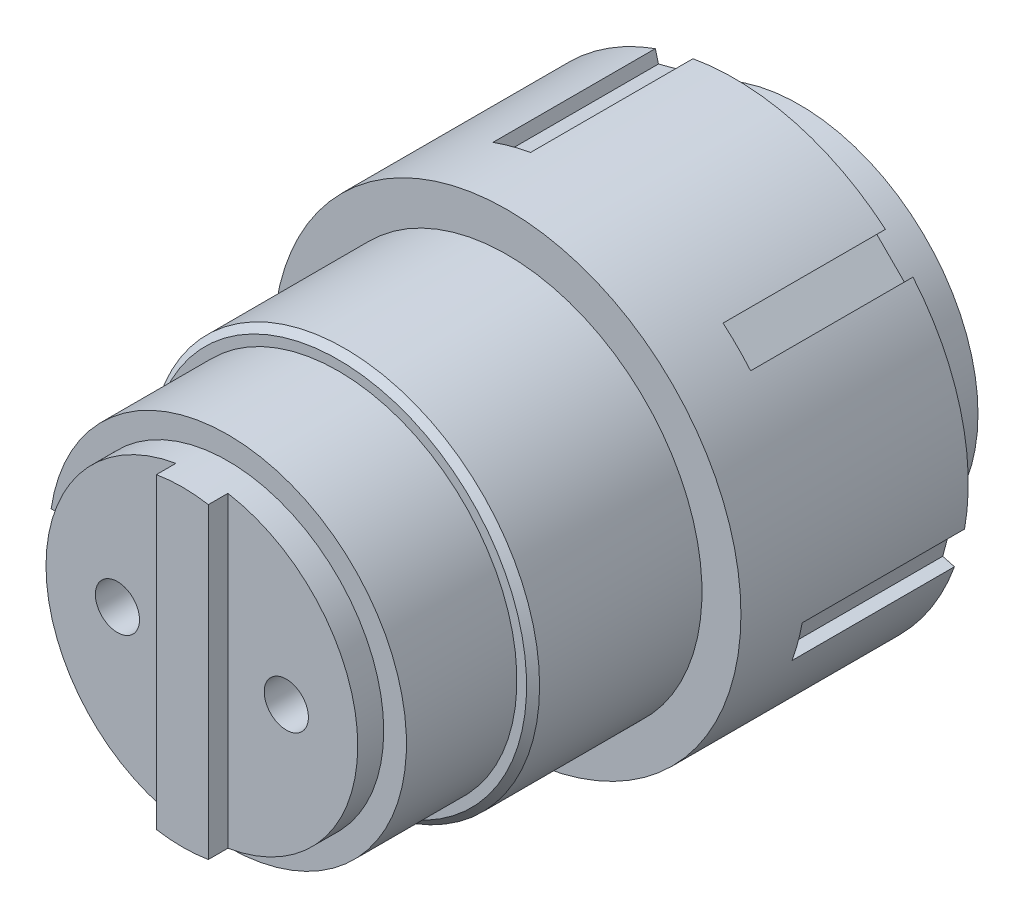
ISO-10303-21;
HEADER;
FILE_DESCRIPTION(('STEP AP214'),'2;1');
FILE_NAME('part.step','',(''),(''),'','','');
FILE_SCHEMA(('AUTOMOTIVE_DESIGN { 1 0 10303 214 1 1 1 1 }'));
ENDSEC;
DATA;
#1=APPLICATION_CONTEXT('core data for automotive mechanical design processes');
#2=APPLICATION_PROTOCOL_DEFINITION('international standard','automotive_design',2000,#1);
#3=PRODUCT_CONTEXT('',#1,'mechanical');
#4=PRODUCT('Part','Part','',(#3));
#5=PRODUCT_RELATED_PRODUCT_CATEGORY('part','',(#4));
#6=PRODUCT_DEFINITION_FORMATION('','',#4);
#7=PRODUCT_DEFINITION_CONTEXT('part definition',#1,'design');
#8=PRODUCT_DEFINITION('design','',#6,#7);
#9=PRODUCT_DEFINITION_SHAPE('','',#8);
#10=(LENGTH_UNIT() NAMED_UNIT(*) SI_UNIT(.MILLI.,.METRE.));
#11=(NAMED_UNIT(*) PLANE_ANGLE_UNIT() SI_UNIT($,.RADIAN.));
#12=(NAMED_UNIT(*) SI_UNIT($,.STERADIAN.) SOLID_ANGLE_UNIT());
#13=UNCERTAINTY_MEASURE_WITH_UNIT(LENGTH_MEASURE(1.E-05),#10,'distance_accuracy_value','');
#14=(GEOMETRIC_REPRESENTATION_CONTEXT(3) GLOBAL_UNCERTAINTY_ASSIGNED_CONTEXT((#13)) GLOBAL_UNIT_ASSIGNED_CONTEXT((#10,
#11,#12)) REPRESENTATION_CONTEXT('',''));
#15=CARTESIAN_POINT('',(0.,0.,0.));
#16=DIRECTION('',(0.,0.,1.));
#17=DIRECTION('',(1.,0.,0.));
#18=AXIS2_PLACEMENT_3D('',#15,#16,#17);
#19=CARTESIAN_POINT('',(0.,0.,92.));
#20=DIRECTION('',(0.,0.,1.));
#21=DIRECTION('',(1.,0.,0.));
#22=AXIS2_PLACEMENT_3D('',#19,#20,#21);
#23=PLANE('',#22);
#24=CARTESIAN_POINT('',(-13.,0.,92.));
#25=DIRECTION('',(0.,0.,1.));
#26=DIRECTION('',(1.,0.,0.));
#27=AXIS2_PLACEMENT_3D('',#24,#25,#26);
#28=CIRCLE('',#27,3.4);
#29=CARTESIAN_POINT('',(-9.6,0.,92.));
#30=VERTEX_POINT('',#29);
#31=EDGE_CURVE('E457',#30,#30,#28,.T.);
#32=ORIENTED_EDGE('',*,*,#31,.F.);
#33=EDGE_LOOP('',(#32));
#34=FACE_BOUND('',#33,.T.);
#35=CARTESIAN_POINT('',(0.,0.,92.));
#36=DIRECTION('',(0.,0.,1.));
#37=DIRECTION('',(1.,0.,0.));
#38=AXIS2_PLACEMENT_3D('',#35,#36,#37);
#39=CIRCLE('',#38,24.);
#40=CARTESIAN_POINT('',(-3.99999999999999,23.6643191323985,92.));
#41=VERTEX_POINT('',#40);
#42=CARTESIAN_POINT('',(-3.99999999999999,-23.6643191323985,92.));
#43=VERTEX_POINT('',#42);
#44=EDGE_CURVE('E501',#41,#43,#39,.T.);
#45=ORIENTED_EDGE('',*,*,#44,.T.);
#46=DIRECTION('',(0.,1.,0.));
#47=VECTOR('',#46,1.);
#48=CARTESIAN_POINT('',(-3.99999999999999,0.,92.));
#49=LINE('',#48,#47);
#50=EDGE_CURVE('E627',#43,#41,#49,.T.);
#51=ORIENTED_EDGE('',*,*,#50,.T.);
#52=EDGE_LOOP('',(#45,#51));
#53=FACE_BOUND('',#52,.T.);
#54=ADVANCED_FACE('F37',(#34,#53),#23,.T.);
#55=CARTESIAN_POINT('',(13.,0.,92.));
#56=DIRECTION('',(0.,0.,1.));
#57=DIRECTION('',(1.,0.,0.));
#58=AXIS2_PLACEMENT_3D('',#55,#56,#57);
#59=CIRCLE('',#58,3.4);
#60=CARTESIAN_POINT('',(16.4,0.,92.));
#61=VERTEX_POINT('',#60);
#62=EDGE_CURVE('E463',#61,#61,#59,.T.);
#63=ORIENTED_EDGE('',*,*,#62,.F.);
#64=EDGE_LOOP('',(#63));
#65=FACE_BOUND('',#64,.T.);
#66=CARTESIAN_POINT('',(4.00000000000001,-23.6643191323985,92.));
#67=VERTEX_POINT('',#66);
#68=CARTESIAN_POINT('',(4.00000000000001,23.6643191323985,92.));
#69=VERTEX_POINT('',#68);
#70=EDGE_CURVE('E497',#67,#69,#39,.T.);
#71=ORIENTED_EDGE('',*,*,#70,.T.);
#72=DIRECTION('',(0.,-1.,0.));
#73=VECTOR('',#72,1.);
#74=CARTESIAN_POINT('',(4.00000000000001,0.,92.));
#75=LINE('',#74,#73);
#76=EDGE_CURVE('E635',#69,#67,#75,.T.);
#77=ORIENTED_EDGE('',*,*,#76,.T.);
#78=EDGE_LOOP('',(#71,#77));
#79=FACE_BOUND('',#78,.T.);
#80=ADVANCED_FACE('F616',(#65,#79),#23,.T.);
#81=CARTESIAN_POINT('',(0.,0.,92.));
#82=DIRECTION('',(0.,0.,-1.));
#83=DIRECTION('',(-1.,0.,0.));
#84=AXIS2_PLACEMENT_3D('',#81,#82,#83);
#85=CYLINDRICAL_SURFACE('',#84,27.5);
#86=CARTESIAN_POINT('',(0.,0.,88.));
#87=DIRECTION('',(0.,0.,1.));
#88=DIRECTION('',(1.,0.,0.));
#89=AXIS2_PLACEMENT_3D('',#86,#87,#88);
#90=CIRCLE('',#89,27.5);
#91=CARTESIAN_POINT('',(-27.2075357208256,-4.,88.));
#92=VERTEX_POINT('',#91);
#93=CARTESIAN_POINT('',(-27.2075357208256,4.,88.));
#94=VERTEX_POINT('',#93);
#95=EDGE_CURVE('E492',#92,#94,#90,.T.);
#96=ORIENTED_EDGE('',*,*,#95,.F.);
#97=DIRECTION('',(0.,0.,-1.));
#98=VECTOR('',#97,1.);
#99=CARTESIAN_POINT('',(-27.2075357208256,-4.,92.));
#100=LINE('',#99,#98);
#101=CARTESIAN_POINT('',(-27.2075357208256,-4.,71.));
#102=VERTEX_POINT('',#101);
#103=EDGE_CURVE('E525',#102,#92,#100,.F.);
#104=ORIENTED_EDGE('',*,*,#103,.F.);
#105=CARTESIAN_POINT('',(0.,0.,71.));
#106=DIRECTION('',(0.,0.,-1.));
#107=DIRECTION('',(-1.,0.,0.));
#108=AXIS2_PLACEMENT_3D('',#105,#106,#107);
#109=CIRCLE('',#108,27.5);
#110=CARTESIAN_POINT('',(-27.2075357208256,4.,71.));
#111=VERTEX_POINT('',#110);
#112=EDGE_CURVE('E542',#111,#102,#109,.T.);
#113=ORIENTED_EDGE('',*,*,#112,.F.);
#114=DIRECTION('',(0.,0.,-1.));
#115=VECTOR('',#114,1.);
#116=CARTESIAN_POINT('',(-27.2075357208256,4.,92.));
#117=LINE('',#116,#115);
#118=EDGE_CURVE('E518',#111,#94,#117,.F.);
#119=ORIENTED_EDGE('',*,*,#118,.T.);
#120=EDGE_LOOP('',(#96,#104,#113,#119));
#121=FACE_BOUND('',#120,.T.);
#122=ADVANCED_FACE('F621',(#121),#85,.T.);
#123=CARTESIAN_POINT('',(-25.,-4.,94.));
#124=DIRECTION('',(1.,0.,0.));
#125=DIRECTION('',(0.,0.,-1.));
#126=AXIS2_PLACEMENT_3D('',#123,#124,#125);
#127=PLANE('',#126);
#128=DIRECTION('',(0.,-1.,0.));
#129=VECTOR('',#128,1.);
#130=CARTESIAN_POINT('',(-25.,-4.,88.));
#131=LINE('',#130,#129);
#132=CARTESIAN_POINT('',(-25.,4.,88.));
#133=VERTEX_POINT('',#132);
#134=CARTESIAN_POINT('',(-25.,-4.,88.));
#135=VERTEX_POINT('',#134);
#136=EDGE_CURVE('E490',#133,#135,#131,.T.);
#137=ORIENTED_EDGE('',*,*,#136,.F.);
#138=DIRECTION('',(0.,0.,-1.));
#139=VECTOR('',#138,1.);
#140=CARTESIAN_POINT('',(-25.,4.,94.));
#141=LINE('',#140,#139);
#142=CARTESIAN_POINT('',(-25.,4.,68.));
#143=VERTEX_POINT('',#142);
#144=EDGE_CURVE('E498',#133,#143,#141,.T.);
#145=ORIENTED_EDGE('',*,*,#144,.T.);
#146=DIRECTION('',(0.,1.,0.));
#147=VECTOR('',#146,1.);
#148=CARTESIAN_POINT('',(-25.,-4.,68.));
#149=LINE('',#148,#147);
#150=CARTESIAN_POINT('',(-25.,-4.,68.));
#151=VERTEX_POINT('',#150);
#152=EDGE_CURVE('E509',#151,#143,#149,.T.);
#153=ORIENTED_EDGE('',*,*,#152,.F.);
#154=DIRECTION('',(0.,0.,-1.));
#155=VECTOR('',#154,1.);
#156=CARTESIAN_POINT('',(-25.,-4.,94.));
#157=LINE('',#156,#155);
#158=EDGE_CURVE('E504',#135,#151,#157,.T.);
#159=ORIENTED_EDGE('',*,*,#158,.F.);
#160=EDGE_LOOP('',(#137,#145,#153,#159));
#161=FACE_BOUND('',#160,.T.);
#162=ADVANCED_FACE('F583',(#161),#127,.F.);
#163=CARTESIAN_POINT('',(-45.,-4.,68.));
#164=DIRECTION('',(0.,1.,0.));
#165=DIRECTION('',(0.,0.,1.));
#166=AXIS2_PLACEMENT_3D('',#163,#164,#165);
#167=PLANE('',#166);
#168=ORIENTED_EDGE('',*,*,#103,.T.);
#169=DIRECTION('',(1.,0.,0.));
#170=VECTOR('',#169,1.);
#171=CARTESIAN_POINT('',(-45.,-4.,88.));
#172=LINE('',#171,#170);
#173=EDGE_CURVE('E494',#92,#135,#172,.T.);
#174=ORIENTED_EDGE('',*,*,#173,.T.);
#175=ORIENTED_EDGE('',*,*,#158,.T.);
#176=CARTESIAN_POINT('',(-45.,-4.,68.));
#177=DIRECTION('',(0.,1.,0.));
#178=DIRECTION('',(0.,0.,1.));
#179=AXIS2_PLACEMENT_3D('',#176,#177,#178);
#180=CIRCLE('',#179,20.);
#181=CARTESIAN_POINT('',(-29.732137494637,-4.,55.0813168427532));
#182=VERTEX_POINT('',#181);
#183=EDGE_CURVE('E506',#151,#182,#180,.T.);
#184=ORIENTED_EDGE('',*,*,#183,.T.);
#185=DIRECTION('',(0.,0.,-1.));
#186=VECTOR('',#185,1.);
#187=CARTESIAN_POINT('',(-29.732137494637,-4.,0.));
#188=LINE('',#187,#186);
#189=CARTESIAN_POINT('',(-29.732137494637,-4.,70.));
#190=VERTEX_POINT('',#189);
#191=EDGE_CURVE('E521',#182,#190,#188,.F.);
#192=ORIENTED_EDGE('',*,*,#191,.T.);
#193=CARTESIAN_POINT('',(-22.5537523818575,-4.,77.0942857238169));
#194=CARTESIAN_POINT('',(-23.117078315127,-4.,76.5396063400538));
#195=CARTESIAN_POINT('',(-23.6800970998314,-4.,75.9846152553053));
#196=CARTESIAN_POINT('',(-24.8056197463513,-4.,74.8741114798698));
#197=CARTESIAN_POINT('',(-25.3681236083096,-4.,74.3185987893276));
#198=CARTESIAN_POINT('',(-27.0550109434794,-4.,72.6514319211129));
#199=CARTESIAN_POINT('',(-28.1787715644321,-4.,71.5391475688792));
#200=CARTESIAN_POINT('',(-30.4251425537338,-4.,69.3134201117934));
#201=CARTESIAN_POINT('',(-31.5477529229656,-4.,68.1999770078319));
#202=CARTESIAN_POINT('',(-33.792118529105,-4.,65.9722264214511));
#203=CARTESIAN_POINT('',(-34.913873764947,-4.,64.857918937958));
#204=CARTESIAN_POINT('',(-36.0353471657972,-4.,63.7433282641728));
#205=B_SPLINE_CURVE_WITH_KNOTS('',3,(#193,#194,#195,#196,#197,#198,#199,#200,#201,#202,#203,
#204),.UNSPECIFIED.,.F.,.F.,(4,2,2,2,2,4),(0.,2.37171798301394,4.74343530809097,
9.48686406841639,14.2302891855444,18.9737202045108),.UNSPECIFIED.);
#206=CARTESIAN_POINT('',(-28.7228132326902,-4.,71.));
#207=VERTEX_POINT('',#206);
#208=EDGE_CURVE('E561',#207,#190,#205,.T.);
#209=ORIENTED_EDGE('',*,*,#208,.F.);
#210=DIRECTION('',(1.,0.,0.));
#211=VECTOR('',#210,1.);
#212=CARTESIAN_POINT('',(30.,-4.,71.));
#213=LINE('',#212,#211);
#214=EDGE_CURVE('E523',#207,#102,#213,.T.);
#215=ORIENTED_EDGE('',*,*,#214,.T.);
#216=EDGE_LOOP('',(#168,#174,#175,#184,#192,#209,#215));
#217=FACE_BOUND('',#216,.T.);
#218=ADVANCED_FACE('F576',(#217),#167,.T.);
#219=CARTESIAN_POINT('',(-45.,4.,68.));
#220=DIRECTION('',(0.,1.,0.));
#221=DIRECTION('',(0.,0.,1.));
#222=AXIS2_PLACEMENT_3D('',#219,#220,#221);
#223=PLANE('',#222);
#224=DIRECTION('',(1.,0.,0.));
#225=VECTOR('',#224,1.);
#226=CARTESIAN_POINT('',(-45.,4.,88.));
#227=LINE('',#226,#225);
#228=EDGE_CURVE('E596',#94,#133,#227,.T.);
#229=ORIENTED_EDGE('',*,*,#228,.F.);
#230=ORIENTED_EDGE('',*,*,#118,.F.);
#231=DIRECTION('',(1.,0.,0.));
#232=VECTOR('',#231,1.);
#233=CARTESIAN_POINT('',(30.,4.,71.));
#234=LINE('',#233,#232);
#235=CARTESIAN_POINT('',(-28.7228132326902,4.,71.));
#236=VERTEX_POINT('',#235);
#237=EDGE_CURVE('E515',#236,#111,#234,.T.);
#238=ORIENTED_EDGE('',*,*,#237,.F.);
#239=CARTESIAN_POINT('',(-22.5537523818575,4.,77.0942857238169));
#240=CARTESIAN_POINT('',(-23.117078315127,4.,76.5396063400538));
#241=CARTESIAN_POINT('',(-23.6800970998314,4.,75.9846152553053));
#242=CARTESIAN_POINT('',(-24.8056197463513,4.,74.8741114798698));
#243=CARTESIAN_POINT('',(-25.3681236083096,4.,74.3185987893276));
#244=CARTESIAN_POINT('',(-27.0550109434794,4.,72.6514319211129));
#245=CARTESIAN_POINT('',(-28.1787715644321,4.,71.5391475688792));
#246=CARTESIAN_POINT('',(-30.4251425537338,4.,69.3134201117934));
#247=CARTESIAN_POINT('',(-31.5477529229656,4.,68.1999770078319));
#248=CARTESIAN_POINT('',(-33.792118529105,4.,65.9722264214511));
#249=CARTESIAN_POINT('',(-34.913873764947,4.,64.857918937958));
#250=CARTESIAN_POINT('',(-36.0353471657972,4.,63.7433282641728));
#251=B_SPLINE_CURVE_WITH_KNOTS('',3,(#239,#240,#241,#242,#243,#244,#245,#246,#247,#248,#249,
#250),.UNSPECIFIED.,.F.,.F.,(4,2,2,2,2,4),(0.,2.37171798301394,4.74343530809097,
9.48686406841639,14.2302891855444,18.9737202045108),.UNSPECIFIED.);
#252=CARTESIAN_POINT('',(-29.732137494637,4.,70.));
#253=VERTEX_POINT('',#252);
#254=EDGE_CURVE('E554',#236,#253,#251,.T.);
#255=ORIENTED_EDGE('',*,*,#254,.T.);
#256=DIRECTION('',(0.,0.,-1.));
#257=VECTOR('',#256,1.);
#258=CARTESIAN_POINT('',(-29.732137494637,4.,0.));
#259=LINE('',#258,#257);
#260=CARTESIAN_POINT('',(-29.732137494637,4.,55.0813168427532));
#261=VERTEX_POINT('',#260);
#262=EDGE_CURVE('E512',#261,#253,#259,.F.);
#263=ORIENTED_EDGE('',*,*,#262,.F.);
#264=CARTESIAN_POINT('',(-45.,4.,68.));
#265=DIRECTION('',(0.,1.,0.));
#266=DIRECTION('',(0.,0.,1.));
#267=AXIS2_PLACEMENT_3D('',#264,#265,#266);
#268=CIRCLE('',#267,20.);
#269=EDGE_CURVE('E500',#143,#261,#268,.T.);
#270=ORIENTED_EDGE('',*,*,#269,.F.);
#271=ORIENTED_EDGE('',*,*,#144,.F.);
#272=EDGE_LOOP('',(#229,#230,#238,#255,#263,#270,#271));
#273=FACE_BOUND('',#272,.T.);
#274=ADVANCED_FACE('F571',(#273),#223,.F.);
#275=CARTESIAN_POINT('',(30.,0.,71.));
#276=DIRECTION('',(0.,0.,-1.));
#277=DIRECTION('',(-1.,0.,0.));
#278=AXIS2_PLACEMENT_3D('',#275,#276,#277);
#279=PLANE('',#278);
#280=ORIENTED_EDGE('',*,*,#214,.F.);
#281=CARTESIAN_POINT('',(0.,0.,71.));
#282=DIRECTION('',(0.,0.,-1.));
#283=DIRECTION('',(-1.,0.,0.));
#284=AXIS2_PLACEMENT_3D('',#281,#282,#283);
#285=CIRCLE('',#284,29.);
#286=EDGE_CURVE('E551',#207,#236,#285,.F.);
#287=ORIENTED_EDGE('',*,*,#286,.T.);
#288=ORIENTED_EDGE('',*,*,#237,.T.);
#289=ORIENTED_EDGE('',*,*,#112,.T.);
#290=EDGE_LOOP('',(#280,#287,#288,#289));
#291=FACE_BOUND('',#290,.T.);
#292=ADVANCED_FACE('F575',(#291),#279,.F.);
#293=CARTESIAN_POINT('',(0.,0.,0.));
#294=DIRECTION('',(0.,0.,-1.));
#295=DIRECTION('',(-1.,0.,0.));
#296=AXIS2_PLACEMENT_3D('',#293,#294,#295);
#297=CYLINDRICAL_SURFACE('',#296,30.);
#298=CARTESIAN_POINT('',(0.,0.,45.));
#299=DIRECTION('',(0.,0.,-1.));
#300=DIRECTION('',(-1.,0.,0.));
#301=AXIS2_PLACEMENT_3D('',#298,#299,#300);
#302=CIRCLE('',#301,30.);
#303=CARTESIAN_POINT('',(-30.,0.,45.));
#304=VERTEX_POINT('',#303);
#305=EDGE_CURVE('E528',#304,#304,#302,.T.);
#306=ORIENTED_EDGE('',*,*,#305,.F.);
#307=EDGE_LOOP('',(#306));
#308=FACE_BOUND('',#307,.T.);
#309=ORIENTED_EDGE('',*,*,#191,.F.);
#310=CARTESIAN_POINT('',(-30.,0.,81.228756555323));
#311=CARTESIAN_POINT('',(-30.0000021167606,-0.516636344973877,81.2287540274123));
#312=CARTESIAN_POINT('',(-29.9866377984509,-1.03323863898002,81.2136500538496));
#313=CARTESIAN_POINT('',(-29.9333970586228,-2.06344066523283,81.1529139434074));
#314=CARTESIAN_POINT('',(-29.8935135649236,-2.57703955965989,81.1072736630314));
#315=CARTESIAN_POINT('',(-29.7878095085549,-3.59869335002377,80.9844458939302));
#316=CARTESIAN_POINT('',(-29.7219437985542,-4.10673700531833,80.9072034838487));
#317=CARTESIAN_POINT('',(-29.5654897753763,-5.11281939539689,80.719701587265));
#318=CARTESIAN_POINT('',(-29.4749035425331,-5.61085896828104,80.6094448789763));
#319=CARTESIAN_POINT('',(-29.2702338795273,-6.59605864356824,80.3531985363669));
#320=CARTESIAN_POINT('',(-29.1560141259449,-7.08313658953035,80.2070006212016));
#321=CARTESIAN_POINT('',(-28.9070483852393,-8.03905808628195,79.8768533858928));
#322=CARTESIAN_POINT('',(-28.7722999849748,-8.50789948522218,79.6928996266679));
#323=CARTESIAN_POINT('',(-28.4862109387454,-9.42148778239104,79.2852398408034));
#324=CARTESIAN_POINT('',(-28.3349056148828,-9.86628306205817,79.0616178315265));
#325=CARTESIAN_POINT('',(-28.0202099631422,-10.7274283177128,78.5721925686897));
#326=CARTESIAN_POINT('',(-27.8568250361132,-11.1437908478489,78.3064081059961));
#327=CARTESIAN_POINT('',(-27.5723709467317,-11.8261866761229,77.814946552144));
#328=CARTESIAN_POINT('',(-27.4528238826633,-12.1007071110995,77.6001059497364));
#329=CARTESIAN_POINT('',(-27.2131034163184,-12.630576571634,77.1483154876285));
#330=CARTESIAN_POINT('',(-27.092930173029,-12.8859302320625,76.911371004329));
#331=CARTESIAN_POINT('',(-26.8546689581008,-13.3753825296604,76.4156134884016));
#332=CARTESIAN_POINT('',(-26.7365803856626,-13.6094873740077,76.156806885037));
#333=CARTESIAN_POINT('',(-26.505318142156,-14.054573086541,75.617918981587));
#334=CARTESIAN_POINT('',(-26.3921446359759,-14.2655531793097,75.3378369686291));
#335=CARTESIAN_POINT('',(-26.1729773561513,-14.6638082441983,74.7557754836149));
#336=CARTESIAN_POINT('',(-26.067033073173,-14.8509262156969,74.4536696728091));
#337=CARTESIAN_POINT('',(-25.8660580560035,-15.1982675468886,73.8308917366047));
#338=CARTESIAN_POINT('',(-25.7710275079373,-15.3584904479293,73.5102192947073));
#339=CARTESIAN_POINT('',(-25.5946609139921,-15.6506380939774,72.8526938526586));
#340=CARTESIAN_POINT('',(-25.5133218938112,-15.782568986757,72.5158443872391));
#341=CARTESIAN_POINT('',(-25.3667526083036,-16.0170853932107,71.828700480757));
#342=CARTESIAN_POINT('',(-25.3015205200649,-16.1196742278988,71.4784075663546));
#343=CARTESIAN_POINT('',(-25.1952394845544,-16.2852229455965,70.8061401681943));
#344=CARTESIAN_POINT('',(-25.1523348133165,-16.3512744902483,70.4852158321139));
#345=CARTESIAN_POINT('',(-25.0819408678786,-16.4590523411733,69.8376500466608));
#346=CARTESIAN_POINT('',(-25.0544504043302,-16.5007805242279,69.5110090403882));
#347=CARTESIAN_POINT('',(-25.0155664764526,-16.5596703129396,68.8546722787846));
#348=CARTESIAN_POINT('',(-25.0041680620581,-16.5768394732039,68.5249774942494));
#349=CARTESIAN_POINT('',(-24.997733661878,-16.5865412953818,67.8650664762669));
#350=CARTESIAN_POINT('',(-25.0026973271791,-16.5790744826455,67.5348502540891));
#351=CARTESIAN_POINT('',(-25.028158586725,-16.5406094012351,66.8942168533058));
#352=CARTESIAN_POINT('',(-25.0478087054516,-16.5108947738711,66.5836877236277));
#353=CARTESIAN_POINT('',(-25.101212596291,-16.4295919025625,65.9667475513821));
#354=CARTESIAN_POINT('',(-25.1349656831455,-16.3780047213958,65.6603363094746));
#355=CARTESIAN_POINT('',(-25.2158277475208,-16.2532318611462,65.0537939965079));
#356=CARTESIAN_POINT('',(-25.2629347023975,-16.1800494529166,64.7536619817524));
#357=CARTESIAN_POINT('',(-25.3694793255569,-16.0124752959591,64.1616238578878));
#358=CARTESIAN_POINT('',(-25.4289172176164,-15.9180831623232,63.8697178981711));
#359=CARTESIAN_POINT('',(-25.5593672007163,-15.7077741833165,63.2936507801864));
#360=CARTESIAN_POINT('',(-25.6304688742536,-15.5916896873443,63.0095711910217));
#361=CARTESIAN_POINT('',(-25.7823705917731,-15.3392000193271,62.4533019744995));
#362=CARTESIAN_POINT('',(-25.8631705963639,-15.202794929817,62.1811122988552));
#363=CARTESIAN_POINT('',(-26.03278075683,-14.9104950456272,61.6500144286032));
#364=CARTESIAN_POINT('',(-26.1215913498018,-14.7545991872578,61.3911069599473));
#365=CARTESIAN_POINT('',(-26.3054285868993,-14.4242901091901,60.8876988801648));
#366=CARTESIAN_POINT('',(-26.4004558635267,-14.2498750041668,60.6431997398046));
#367=CARTESIAN_POINT('',(-26.6012285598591,-13.871675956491,60.15400695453));
#368=CARTESIAN_POINT('',(-26.7072687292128,-13.6667181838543,59.9103420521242));
#369=CARTESIAN_POINT('',(-26.9221051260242,-13.2384906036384,59.4410077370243));
#370=CARTESIAN_POINT('',(-27.0309014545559,-13.0152201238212,59.2153389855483));
#371=CARTESIAN_POINT('',(-27.2491669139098,-12.5518324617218,58.7822588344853));
#372=CARTESIAN_POINT('',(-27.3586362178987,-12.3117107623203,58.5748523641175));
#373=CARTESIAN_POINT('',(-27.5762610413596,-11.8162204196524,58.1783668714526));
#374=CARTESIAN_POINT('',(-27.6844164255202,-11.5608502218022,57.9892897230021));
#375=CARTESIAN_POINT('',(-27.9119257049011,-11.0012456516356,57.6050954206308));
#376=CARTESIAN_POINT('',(-28.0308360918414,-10.6950511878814,57.4125691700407));
#377=CARTESIAN_POINT('',(-28.2623771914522,-10.0672737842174,57.0501949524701));
#378=CARTESIAN_POINT('',(-28.3750074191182,-9.74568965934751,56.8803487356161));
#379=CARTESIAN_POINT('',(-28.5920954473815,-9.08909706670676,56.5624416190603));
#380=CARTESIAN_POINT('',(-28.696549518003,-8.75408257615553,56.4143906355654));
#381=CARTESIAN_POINT('',(-28.8956207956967,-8.07273882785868,56.139232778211));
#382=CARTESIAN_POINT('',(-28.9902374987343,-7.72640899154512,56.0121269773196));
#383=CARTESIAN_POINT('',(-29.1849068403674,-6.95885920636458,55.7560895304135));
#384=CARTESIAN_POINT('',(-29.2826909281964,-6.53570270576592,55.6312252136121));
#385=CARTESIAN_POINT('',(-29.460860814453,-5.67884307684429,55.4081168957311));
#386=CARTESIAN_POINT('',(-29.5412448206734,-5.24513886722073,55.3098756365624));
#387=CARTESIAN_POINT('',(-29.6833946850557,-4.36954134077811,55.1386628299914));
#388=CARTESIAN_POINT('',(-29.7451509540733,-3.92764393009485,55.0657042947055));
#389=CARTESIAN_POINT('',(-29.849113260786,-3.03824960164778,54.9440815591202));
#390=CARTESIAN_POINT('',(-29.8913183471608,-2.59075241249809,54.8954185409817));
#391=CARTESIAN_POINT('',(-29.96089714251,-1.61849363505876,54.8155879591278));
#392=CARTESIAN_POINT('',(-29.9846919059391,-1.0931243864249,54.788611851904));
#393=CARTESIAN_POINT('',(-30.0045855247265,-0.0411566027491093,54.7660382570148));
#394=CARTESIAN_POINT('',(-30.0006814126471,0.485442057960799,54.770444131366));
#395=CARTESIAN_POINT('',(-29.965222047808,1.53703720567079,54.8107548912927));
#396=CARTESIAN_POINT('',(-29.9336393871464,2.06203158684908,54.8466909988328));
#397=CARTESIAN_POINT('',(-29.8433351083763,3.10646143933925,54.9508524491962));
#398=CARTESIAN_POINT('',(-29.7846136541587,3.62589694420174,55.0190775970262));
#399=CARTESIAN_POINT('',(-29.6371991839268,4.68367280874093,55.19382267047));
#400=CARTESIAN_POINT('',(-29.5470483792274,5.22150261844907,55.3022253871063));
#401=CARTESIAN_POINT('',(-29.339785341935,6.28244515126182,55.5587435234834));
#402=CARTESIAN_POINT('',(-29.222669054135,6.80555564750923,55.7068649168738));
#403=CARTESIAN_POINT('',(-28.9647298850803,7.83092636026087,56.045281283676));
#404=CARTESIAN_POINT('',(-28.8239483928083,8.3332211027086,56.2355028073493));
#405=CARTESIAN_POINT('',(-28.5227625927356,9.31202583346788,56.6611918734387));
#406=CARTESIAN_POINT('',(-28.3623673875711,9.78854763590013,56.8966384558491));
#407=CARTESIAN_POINT('',(-28.0776715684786,10.5717856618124,57.3378467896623));
#408=CARTESIAN_POINT('',(-27.95691035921,10.8866872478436,57.5314496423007));
#409=CARTESIAN_POINT('',(-27.7109363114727,11.4983713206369,57.9428774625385));
#410=CARTESIAN_POINT('',(-27.5857246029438,11.7951583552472,58.1606963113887));
#411=CARTESIAN_POINT('',(-27.3336327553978,12.3681234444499,58.6208617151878));
#412=CARTESIAN_POINT('',(-27.2067533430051,12.6443101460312,58.8631978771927));
#413=CARTESIAN_POINT('',(-26.9543479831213,13.1738056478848,59.3724180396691));
#414=CARTESIAN_POINT('',(-26.8288220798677,13.4271137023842,59.6393028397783));
#415=CARTESIAN_POINT('',(-26.5815072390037,13.9103464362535,60.1991376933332));
#416=CARTESIAN_POINT('',(-26.459754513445,14.1400760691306,60.4922726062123));
#417=CARTESIAN_POINT('',(-26.2245407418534,14.5716816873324,61.1015419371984));
#418=CARTESIAN_POINT('',(-26.1110798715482,14.7735570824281,61.4176768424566));
#419=CARTESIAN_POINT('',(-25.895995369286,15.1474075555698,62.0708217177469));
#420=CARTESIAN_POINT('',(-25.7943672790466,15.319393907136,62.4078237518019));
#421=CARTESIAN_POINT('',(-25.6061916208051,15.6318991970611,63.1001246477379));
#422=CARTESIAN_POINT('',(-25.5196417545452,15.7724229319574,63.4554207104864));
#423=CARTESIAN_POINT('',(-25.3745361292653,16.0046603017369,64.134052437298));
#424=CARTESIAN_POINT('',(-25.3138071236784,16.1003370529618,64.4555742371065));
#425=CARTESIAN_POINT('',(-25.2075061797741,16.2662645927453,65.1075556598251));
#426=CARTESIAN_POINT('',(-25.1619328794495,16.3365176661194,65.438014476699));
#427=CARTESIAN_POINT('',(-25.0871415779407,16.4511403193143,66.1050899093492));
#428=CARTESIAN_POINT('',(-25.057917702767,16.495519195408,66.4417042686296));
#429=CARTESIAN_POINT('',(-25.0165655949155,16.5581662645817,67.1183949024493));
#430=CARTESIAN_POINT('',(-25.0044366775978,16.5764355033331,67.4584710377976));
#431=CARTESIAN_POINT('',(-24.9978466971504,16.5863698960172,68.1133652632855));
#432=CARTESIAN_POINT('',(-25.0021160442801,16.5799467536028,68.4281438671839));
#433=CARTESIAN_POINT('',(-25.0254226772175,16.5447475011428,69.0558842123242));
#434=CARTESIAN_POINT('',(-25.0444589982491,16.5159728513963,69.3688460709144));
#435=CARTESIAN_POINT('',(-25.0968674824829,16.4362255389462,69.9906397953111));
#436=CARTESIAN_POINT('',(-25.1302365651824,16.3852576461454,70.2994725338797));
#437=CARTESIAN_POINT('',(-25.2105660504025,16.2613898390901,70.9109077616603));
#438=CARTESIAN_POINT('',(-25.2575266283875,16.188489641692,71.2135101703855));
#439=CARTESIAN_POINT('',(-25.363661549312,16.0216843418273,71.8085396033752));
#440=CARTESIAN_POINT('',(-25.4227567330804,15.9279150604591,72.1010188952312));
#441=CARTESIAN_POINT('',(-25.5520614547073,15.7196426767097,72.6759500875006));
#442=CARTESIAN_POINT('',(-25.6222708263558,15.6051398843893,72.9584021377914));
#443=CARTESIAN_POINT('',(-25.7723180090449,15.3560654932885,73.5116613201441));
#444=CARTESIAN_POINT('',(-25.8521562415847,15.2214930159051,73.7824679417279));
#445=CARTESIAN_POINT('',(-26.0198080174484,14.9330974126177,74.3110381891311));
#446=CARTESIAN_POINT('',(-26.1076218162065,14.7792736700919,74.568801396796));
#447=CARTESIAN_POINT('',(-26.2939357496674,14.4453195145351,75.0824732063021));
#448=CARTESIAN_POINT('',(-26.3927488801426,14.264268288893,75.3376693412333));
#449=CARTESIAN_POINT('',(-26.5951807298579,13.8831883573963,75.8315971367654));
#450=CARTESIAN_POINT('',(-26.6988014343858,13.6831517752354,76.0703218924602));
#451=CARTESIAN_POINT('',(-26.9087648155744,13.2654815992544,76.5306047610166));
#452=CARTESIAN_POINT('',(-27.0151079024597,13.0478453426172,76.752160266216));
#453=CARTESIAN_POINT('',(-27.2284879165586,12.5964973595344,77.1776908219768));
#454=CARTESIAN_POINT('',(-27.3355246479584,12.3627900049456,77.3816706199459));
#455=CARTESIAN_POINT('',(-27.5608291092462,11.8527271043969,77.7947390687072));
#456=CARTESIAN_POINT('',(-27.6789597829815,11.5745687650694,78.0016769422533));
#457=CARTESIAN_POINT('',(-27.9114983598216,11.0019890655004,78.3939948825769));
#458=CARTESIAN_POINT('',(-28.0259060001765,10.7075665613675,78.5793734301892));
#459=CARTESIAN_POINT('',(-28.2490289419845,10.1042497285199,78.9292291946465));
#460=CARTESIAN_POINT('',(-28.3577406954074,9.79534660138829,79.093693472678));
#461=CARTESIAN_POINT('',(-28.5676630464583,9.16509666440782,79.4023302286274));
#462=CARTESIAN_POINT('',(-28.6688727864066,8.84374843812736,79.5465003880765));
#463=CARTESIAN_POINT('',(-28.8795280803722,8.13227005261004,79.839277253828));
#464=CARTESIAN_POINT('',(-28.9872374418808,7.74007082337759,79.9841134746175));
#465=CARTESIAN_POINT('',(-29.188287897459,6.94353403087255,80.2481545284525));
#466=CARTESIAN_POINT('',(-29.2816268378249,6.53919465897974,80.3673555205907));
#467=CARTESIAN_POINT('',(-29.4524144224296,5.72100099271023,80.5813884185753));
#468=CARTESIAN_POINT('',(-29.5298687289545,5.30715014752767,80.6762290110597));
#469=CARTESIAN_POINT('',(-29.6678127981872,4.47213928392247,80.8427281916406));
#470=CARTESIAN_POINT('',(-29.728305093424,4.05098036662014,80.9143902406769));
#471=CARTESIAN_POINT('',(-29.852691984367,3.02963958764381,81.0603182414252));
#472=CARTESIAN_POINT('',(-29.907833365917,2.4267810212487,81.1236304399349));
#473=CARTESIAN_POINT('',(-29.9814865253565,1.21593266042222,81.2078515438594));
#474=CARTESIAN_POINT('',(-29.9999975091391,0.607942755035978,81.2287595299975));
#475=CARTESIAN_POINT('',(-30.,0.,81.228756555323));
#476=B_SPLINE_CURVE_WITH_KNOTS('',3,(#310,#311,#312,#313,#314,#315,#316,#317,#318,#319,#320,
#321,#322,#323,#324,#325,#326,#327,#328,#329,#330,#331,#332,#333,#334,#335,#336,#337,#338,#339,
#340,#341,#342,#343,#344,#345,#346,#347,#348,#349,#350,#351,#352,#353,#354,#355,#356,#357,#358,
#359,#360,#361,#362,#363,#364,#365,#366,#367,#368,#369,#370,#371,#372,#373,#374,#375,#376,#377,
#378,#379,#380,#381,#382,#383,#384,#385,#386,#387,#388,#389,#390,#391,#392,#393,#394,#395,#396,
#397,#398,#399,#400,#401,#402,#403,#404,#405,#406,#407,#408,#409,#410,#411,#412,#413,#414,#415,
#416,#417,#418,#419,#420,#421,#422,#423,#424,#425,#426,#427,#428,#429,#430,#431,#432,#433,#434,
#435,#436,#437,#438,#439,#440,#441,#442,#443,#444,#445,#446,#447,#448,#449,#450,#451,#452,#453,
#454,#455,#456,#457,#458,#459,#460,#461,#462,#463,#464,#465,#466,#467,#468,#469,#470,#471,#472,
#473,#474,#475),.UNSPECIFIED.,.T.,.F.,(4,2,2,2,2,2,2,2,2,2,2,2,2,2,2,2,2,2,2,2,2,2,2,2,2,2,2,2,
2,2,2,2,2,2,2,2,2,2,2,2,2,2,2,2,2,2,2,2,2,2,2,2,2,2,2,2,2,2,2,2,2,2,2,2,2,2,2,2,2,2,2,2,2,2,2,2,
2,2,2,2,2,2,4),(0.,1.54945436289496,3.09932210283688,4.65189487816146,6.20433703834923,
7.76599698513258,9.3278406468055,10.8864149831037,12.4442966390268,13.5488233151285,
14.6530820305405,15.7570171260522,16.8609892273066,17.9718863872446,19.082802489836,
20.1934769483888,21.3040256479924,22.294103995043,23.284105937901,24.2738032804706,
25.2634795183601,26.2000723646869,27.1366197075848,28.0730252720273,29.0094478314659,
29.9534316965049,30.8974117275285,31.8414432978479,32.7855710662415,33.7913169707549,
34.7970998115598,35.8031532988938,36.8093095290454,37.9504077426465,39.0915939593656,
40.2332977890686,41.3750600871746,42.7294307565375,44.0839408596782,45.4391470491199,
46.7944191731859,48.3724968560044,49.9507436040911,51.5305549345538,53.1103567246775,
54.7761743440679,56.4422426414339,58.1054268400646,59.7678420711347,60.9334121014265,
62.0986882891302,63.2634725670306,64.4282947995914,65.6020851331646,66.7759003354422,
67.9492718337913,69.1224643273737,70.1438391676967,71.1651221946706,72.1860380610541,
73.2069130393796,74.1504021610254,75.0938296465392,76.0370544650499,76.9802914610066,
77.9175603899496,78.8548153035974,79.7921112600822,80.7294372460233,81.7127855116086,
82.6965435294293,83.6804506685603,84.6640912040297,85.7618026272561,86.8595913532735,
87.9580559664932,89.056645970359,90.3506045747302,91.6447569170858,92.9384471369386,
94.2319440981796,96.0551978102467,97.878491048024),.UNSPECIFIED.);
#477=EDGE_CURVE('E590',#182,#261,#476,.T.);
#478=ORIENTED_EDGE('',*,*,#477,.T.);
#479=ORIENTED_EDGE('',*,*,#262,.T.);
#480=CARTESIAN_POINT('',(0.,0.,70.));
#481=DIRECTION('',(0.,0.,-1.));
#482=DIRECTION('',(-1.,0.,0.));
#483=AXIS2_PLACEMENT_3D('',#480,#481,#482);
#484=CIRCLE('',#483,30.);
#485=EDGE_CURVE('E548',#253,#190,#484,.T.);
#486=ORIENTED_EDGE('',*,*,#485,.T.);
#487=EDGE_LOOP('',(#309,#478,#479,#486));
#488=FACE_BOUND('',#487,.T.);
#489=ADVANCED_FACE('F598',(#308,#488),#297,.T.);
#490=CARTESIAN_POINT('',(0.,0.,70.));
#491=DIRECTION('',(0.,0.,-1.));
#492=DIRECTION('',(-1.,0.,0.));
#493=AXIS2_PLACEMENT_3D('',#490,#491,#492);
#494=CONICAL_SURFACE('',#493,30.,0.785398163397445);
#495=ORIENTED_EDGE('',*,*,#286,.F.);
#496=ORIENTED_EDGE('',*,*,#208,.T.);
#497=ORIENTED_EDGE('',*,*,#485,.F.);
#498=ORIENTED_EDGE('',*,*,#254,.F.);
#499=EDGE_LOOP('',(#495,#496,#497,#498));
#500=FACE_BOUND('',#499,.T.);
#501=ADVANCED_FACE('F567',(#500),#494,.T.);
#502=CARTESIAN_POINT('',(0.,0.,0.));
#503=DIRECTION('',(0.,0.,1.));
#504=DIRECTION('',(1.,0.,0.));
#505=AXIS2_PLACEMENT_3D('',#502,#503,#504);
#506=CIRCLE('',#505,27.5);
#507=CARTESIAN_POINT('',(27.5,0.,0.));
#508=VERTEX_POINT('',#507);
#509=EDGE_CURVE('E537',#508,#508,#506,.T.);
#510=ORIENTED_EDGE('',*,*,#509,.T.);
#511=EDGE_LOOP('',(#510));
#512=FACE_BOUND('',#511,.T.);
#513=CARTESIAN_POINT('',(0.,0.,9.99999999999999));
#514=DIRECTION('',(0.,0.,1.));
#515=DIRECTION('',(1.,0.,0.));
#516=AXIS2_PLACEMENT_3D('',#513,#514,#515);
#517=CIRCLE('',#516,27.5);
#518=CARTESIAN_POINT('',(27.5,0.,9.99999999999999));
#519=VERTEX_POINT('',#518);
#520=EDGE_CURVE('E545',#519,#519,#517,.T.);
#521=ORIENTED_EDGE('',*,*,#520,.F.);
#522=EDGE_LOOP('',(#521));
#523=FACE_BOUND('',#522,.T.);
#524=ADVANCED_FACE('F39',(#512,#523),#85,.T.);
#525=CARTESIAN_POINT('',(0.,0.,0.));
#526=DIRECTION('',(0.,0.,1.));
#527=DIRECTION('',(1.,0.,0.));
#528=AXIS2_PLACEMENT_3D('',#525,#526,#527);
#529=PLANE('',#528);
#530=CARTESIAN_POINT('',(-20.,0.,0.));
#531=DIRECTION('',(0.,0.,-1.));
#532=DIRECTION('',(-1.,0.,0.));
#533=AXIS2_PLACEMENT_3D('',#530,#531,#532);
#534=CIRCLE('',#533,3.39999999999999);
#535=CARTESIAN_POINT('',(-23.4,0.,0.));
#536=VERTEX_POINT('',#535);
#537=EDGE_CURVE('E421',#536,#536,#534,.T.);
#538=ORIENTED_EDGE('',*,*,#537,.F.);
#539=EDGE_LOOP('',(#538));
#540=FACE_BOUND('',#539,.T.);
#541=CARTESIAN_POINT('',(-10.,-17.3205080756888,0.));
#542=DIRECTION('',(0.,0.,-1.));
#543=DIRECTION('',(-1.,0.,0.));
#544=AXIS2_PLACEMENT_3D('',#541,#542,#543);
#545=CIRCLE('',#544,3.39999999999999);
#546=CARTESIAN_POINT('',(-13.4,-17.3205080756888,0.));
#547=VERTEX_POINT('',#546);
#548=EDGE_CURVE('E427',#547,#547,#545,.T.);
#549=ORIENTED_EDGE('',*,*,#548,.F.);
#550=EDGE_LOOP('',(#549));
#551=FACE_BOUND('',#550,.T.);
#552=CARTESIAN_POINT('',(9.99999999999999,-17.3205080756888,0.));
#553=DIRECTION('',(0.,0.,-1.));
#554=DIRECTION('',(-1.,0.,0.));
#555=AXIS2_PLACEMENT_3D('',#552,#553,#554);
#556=CIRCLE('',#555,3.39999999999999);
#557=CARTESIAN_POINT('',(6.6,-17.3205080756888,0.));
#558=VERTEX_POINT('',#557);
#559=EDGE_CURVE('E433',#558,#558,#556,.T.);
#560=ORIENTED_EDGE('',*,*,#559,.F.);
#561=EDGE_LOOP('',(#560));
#562=FACE_BOUND('',#561,.T.);
#563=CARTESIAN_POINT('',(20.,0.,0.));
#564=DIRECTION('',(0.,0.,-1.));
#565=DIRECTION('',(-1.,0.,0.));
#566=AXIS2_PLACEMENT_3D('',#563,#564,#565);
#567=CIRCLE('',#566,3.39999999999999);
#568=CARTESIAN_POINT('',(16.6,0.,0.));
#569=VERTEX_POINT('',#568);
#570=EDGE_CURVE('E439',#569,#569,#567,.T.);
#571=ORIENTED_EDGE('',*,*,#570,.F.);
#572=EDGE_LOOP('',(#571));
#573=FACE_BOUND('',#572,.T.);
#574=CARTESIAN_POINT('',(10.,17.3205080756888,0.));
#575=DIRECTION('',(0.,0.,-1.));
#576=DIRECTION('',(-1.,0.,0.));
#577=AXIS2_PLACEMENT_3D('',#574,#575,#576);
#578=CIRCLE('',#577,3.39999999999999);
#579=CARTESIAN_POINT('',(6.60000000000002,17.3205080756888,0.));
#580=VERTEX_POINT('',#579);
#581=EDGE_CURVE('E445',#580,#580,#578,.T.);
#582=ORIENTED_EDGE('',*,*,#581,.F.);
#583=EDGE_LOOP('',(#582));
#584=FACE_BOUND('',#583,.T.);
#585=CARTESIAN_POINT('',(-10.,17.3205080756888,0.));
#586=DIRECTION('',(0.,0.,-1.));
#587=DIRECTION('',(-1.,0.,0.));
#588=AXIS2_PLACEMENT_3D('',#585,#586,#587);
#589=CIRCLE('',#588,3.39999999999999);
#590=CARTESIAN_POINT('',(-13.4,17.3205080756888,0.));
#591=VERTEX_POINT('',#590);
#592=EDGE_CURVE('E451',#591,#591,#589,.T.);
#593=ORIENTED_EDGE('',*,*,#592,.F.);
#594=EDGE_LOOP('',(#593));
#595=FACE_BOUND('',#594,.T.);
#596=ORIENTED_EDGE('',*,*,#509,.F.);
#597=EDGE_LOOP('',(#596));
#598=FACE_BOUND('',#597,.T.);
#599=ADVANCED_FACE('F612',(#540,#551,#562,#573,#584,#595,#598),#529,.F.);
#600=CARTESIAN_POINT('',(27.,0.,10.));
#601=DIRECTION('',(0.,0.,1.));
#602=DIRECTION('',(1.,0.,0.));
#603=AXIS2_PLACEMENT_3D('',#600,#601,#602);
#604=PLANE('',#603);
#605=DIRECTION('',(-0.707106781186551,0.707106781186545,0.));
#606=VECTOR('',#605,1.);
#607=CARTESIAN_POINT('',(26.1629509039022,21.9203102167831,10.));
#608=LINE('',#607,#606);
#609=CARTESIAN_POINT('',(26.1629509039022,21.9203102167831,10.));
#610=VERTEX_POINT('',#609);
#611=CARTESIAN_POINT('',(21.9203102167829,26.1629509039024,10.));
#612=VERTEX_POINT('',#611);
#613=EDGE_CURVE('E299',#610,#612,#608,.T.);
#614=ORIENTED_EDGE('',*,*,#613,.F.);
#615=DIRECTION('',(-0.707106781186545,-0.70710678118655,0.));
#616=VECTOR('',#615,1.);
#617=CARTESIAN_POINT('',(33.2340187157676,28.9913780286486,10.));
#618=LINE('',#617,#616);
#619=CARTESIAN_POINT('',(27.4886221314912,23.2459814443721,10.));
#620=VERTEX_POINT('',#619);
#621=EDGE_CURVE('E290',#620,#610,#618,.T.);
#622=ORIENTED_EDGE('',*,*,#621,.F.);
#623=CARTESIAN_POINT('',(0.,0.,10.));
#624=DIRECTION('',(0.,0.,-1.));
#625=DIRECTION('',(-1.,0.,0.));
#626=AXIS2_PLACEMENT_3D('',#623,#624,#625);
#627=CIRCLE('',#626,36.);
#628=CARTESIAN_POINT('',(35.4288358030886,-6.38729940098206,10.));
#629=VERTEX_POINT('',#628);
#630=EDGE_CURVE('E538',#620,#629,#627,.T.);
#631=ORIENTED_EDGE('',*,*,#630,.T.);
#632=DIRECTION('',(0.965925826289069,-0.258819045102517,0.));
#633=VECTOR('',#632,1.);
#634=CARTESIAN_POINT('',(43.2771934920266,-8.49026050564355,10.));
#635=LINE('',#634,#633);
#636=CARTESIAN_POINT('',(33.6179352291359,-5.90207005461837,10.));
#637=VERTEX_POINT('',#636);
#638=EDGE_CURVE('E325',#637,#629,#635,.T.);
#639=ORIENTED_EDGE('',*,*,#638,.F.);
#640=DIRECTION('',(0.258819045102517,0.965925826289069,0.));
#641=VECTOR('',#640,1.);
#642=CARTESIAN_POINT('',(32.0650209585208,-11.6976250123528,10.));
#643=LINE('',#642,#641);
#644=CARTESIAN_POINT('',(32.0650209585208,-11.6976250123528,10.));
#645=VERTEX_POINT('',#644);
#646=EDGE_CURVE('E322',#645,#637,#643,.T.);
#647=ORIENTED_EDGE('',*,*,#646,.F.);
#648=DIRECTION('',(-0.965925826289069,0.258819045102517,0.));
#649=VECTOR('',#648,1.);
#650=CARTESIAN_POINT('',(41.7242792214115,-14.285815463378,10.));
#651=LINE('',#650,#649);
#652=CARTESIAN_POINT('',(33.8759215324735,-12.1828543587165,10.));
#653=VERTEX_POINT('',#652);
#654=EDGE_CURVE('E319',#653,#645,#651,.T.);
#655=ORIENTED_EDGE('',*,*,#654,.F.);
#656=CARTESIAN_POINT('',(12.1828543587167,-33.8759215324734,10.));
#657=VERTEX_POINT('',#656);
#658=EDGE_CURVE('E721',#653,#657,#627,.T.);
#659=ORIENTED_EDGE('',*,*,#658,.T.);
#660=DIRECTION('',(0.258819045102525,-0.965925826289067,0.));
#661=VECTOR('',#660,1.);
#662=CARTESIAN_POINT('',(14.2858154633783,-41.7242792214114,10.));
#663=LINE('',#662,#661);
#664=CARTESIAN_POINT('',(11.697625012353,-32.0650209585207,10.));
#665=VERTEX_POINT('',#664);
#666=EDGE_CURVE('E343',#665,#657,#663,.T.);
#667=ORIENTED_EDGE('',*,*,#666,.F.);
#668=DIRECTION('',(0.965925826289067,0.258819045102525,0.));
#669=VECTOR('',#668,1.);
#670=CARTESIAN_POINT('',(5.90207005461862,-33.6179352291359,10.));
#671=LINE('',#670,#669);
#672=CARTESIAN_POINT('',(5.90207005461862,-33.6179352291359,10.));
#673=VERTEX_POINT('',#672);
#674=EDGE_CURVE('E340',#673,#665,#671,.T.);
#675=ORIENTED_EDGE('',*,*,#674,.F.);
#676=DIRECTION('',(-0.258819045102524,0.965925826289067,0.));
#677=VECTOR('',#676,1.);
#678=CARTESIAN_POINT('',(8.49026050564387,-43.2771934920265,10.));
#679=LINE('',#678,#677);
#680=CARTESIAN_POINT('',(6.38729940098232,-35.4288358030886,10.));
#681=VERTEX_POINT('',#680);
#682=EDGE_CURVE('E336',#681,#673,#679,.T.);
#683=ORIENTED_EDGE('',*,*,#682,.F.);
#684=CARTESIAN_POINT('',(-23.2459814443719,-27.4886221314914,10.));
#685=VERTEX_POINT('',#684);
#686=EDGE_CURVE('E717',#681,#685,#627,.T.);
#687=ORIENTED_EDGE('',*,*,#686,.T.);
#688=DIRECTION('',(-0.707106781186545,-0.70710678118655,0.));
#689=VECTOR('',#688,1.);
#690=CARTESIAN_POINT('',(-28.9913780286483,-33.2340187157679,10.));
#691=LINE('',#690,#689);
#692=CARTESIAN_POINT('',(-21.9203102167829,-26.1629509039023,10.));
#693=VERTEX_POINT('',#692);
#694=EDGE_CURVE('E363',#693,#685,#691,.T.);
#695=ORIENTED_EDGE('',*,*,#694,.F.);
#696=DIRECTION('',(0.707106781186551,-0.707106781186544,0.));
#697=VECTOR('',#696,1.);
#698=CARTESIAN_POINT('',(-26.1629509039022,-21.9203102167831,10.));
#699=LINE('',#698,#697);
#700=CARTESIAN_POINT('',(-26.1629509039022,-21.9203102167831,10.));
#701=VERTEX_POINT('',#700);
#702=EDGE_CURVE('E360',#701,#693,#699,.T.);
#703=ORIENTED_EDGE('',*,*,#702,.F.);
#704=DIRECTION('',(0.707106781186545,0.70710678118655,0.));
#705=VECTOR('',#704,1.);
#706=CARTESIAN_POINT('',(-33.2340187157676,-28.9913780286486,10.));
#707=LINE('',#706,#705);
#708=CARTESIAN_POINT('',(-27.4886221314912,-23.2459814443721,10.));
#709=VERTEX_POINT('',#708);
#710=EDGE_CURVE('E356',#709,#701,#707,.T.);
#711=ORIENTED_EDGE('',*,*,#710,.F.);
#712=CARTESIAN_POINT('',(-35.4288358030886,6.38729940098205,10.));
#713=VERTEX_POINT('',#712);
#714=EDGE_CURVE('E716',#709,#713,#627,.T.);
#715=ORIENTED_EDGE('',*,*,#714,.T.);
#716=DIRECTION('',(-0.965925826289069,0.258819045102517,0.));
#717=VECTOR('',#716,1.);
#718=CARTESIAN_POINT('',(-43.2771934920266,8.49026050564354,10.));
#719=LINE('',#718,#717);
#720=CARTESIAN_POINT('',(-33.6179352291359,5.90207005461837,10.));
#721=VERTEX_POINT('',#720);
#722=EDGE_CURVE('E383',#721,#713,#719,.T.);
#723=ORIENTED_EDGE('',*,*,#722,.F.);
#724=DIRECTION('',(-0.258819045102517,-0.965925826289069,0.));
#725=VECTOR('',#724,1.);
#726=CARTESIAN_POINT('',(-32.0650209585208,11.6976250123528,10.));
#727=LINE('',#726,#725);
#728=CARTESIAN_POINT('',(-32.0650209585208,11.6976250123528,10.));
#729=VERTEX_POINT('',#728);
#730=EDGE_CURVE('E380',#729,#721,#727,.T.);
#731=ORIENTED_EDGE('',*,*,#730,.F.);
#732=DIRECTION('',(0.965925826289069,-0.258819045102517,0.));
#733=VECTOR('',#732,1.);
#734=CARTESIAN_POINT('',(-41.7242792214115,14.285815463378,10.));
#735=LINE('',#734,#733);
#736=CARTESIAN_POINT('',(-33.8759215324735,12.1828543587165,10.));
#737=VERTEX_POINT('',#736);
#738=EDGE_CURVE('E376',#737,#729,#735,.T.);
#739=ORIENTED_EDGE('',*,*,#738,.F.);
#740=CARTESIAN_POINT('',(-12.1828543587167,33.8759215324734,10.));
#741=VERTEX_POINT('',#740);
#742=EDGE_CURVE('E534',#737,#741,#627,.T.);
#743=ORIENTED_EDGE('',*,*,#742,.T.);
#744=DIRECTION('',(-0.258819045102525,0.965925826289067,0.));
#745=VECTOR('',#744,1.);
#746=CARTESIAN_POINT('',(-14.2858154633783,41.7242792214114,10.));
#747=LINE('',#746,#745);
#748=CARTESIAN_POINT('',(-11.697625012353,32.0650209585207,10.));
#749=VERTEX_POINT('',#748);
#750=EDGE_CURVE('E403',#749,#741,#747,.T.);
#751=ORIENTED_EDGE('',*,*,#750,.F.);
#752=DIRECTION('',(-0.965925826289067,-0.258819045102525,0.));
#753=VECTOR('',#752,1.);
#754=CARTESIAN_POINT('',(-5.90207005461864,33.6179352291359,10.));
#755=LINE('',#754,#753);
#756=CARTESIAN_POINT('',(-5.90207005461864,33.6179352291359,10.));
#757=VERTEX_POINT('',#756);
#758=EDGE_CURVE('E400',#757,#749,#755,.T.);
#759=ORIENTED_EDGE('',*,*,#758,.F.);
#760=DIRECTION('',(0.258819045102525,-0.965925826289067,0.));
#761=VECTOR('',#760,1.);
#762=CARTESIAN_POINT('',(-8.49026050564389,43.2771934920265,10.));
#763=LINE('',#762,#761);
#764=CARTESIAN_POINT('',(-6.38729940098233,35.4288358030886,10.));
#765=VERTEX_POINT('',#764);
#766=EDGE_CURVE('E396',#765,#757,#763,.T.);
#767=ORIENTED_EDGE('',*,*,#766,.F.);
#768=CARTESIAN_POINT('',(23.2459814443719,27.4886221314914,10.));
#769=VERTEX_POINT('',#768);
#770=EDGE_CURVE('E535',#765,#769,#627,.T.);
#771=ORIENTED_EDGE('',*,*,#770,.T.);
#772=DIRECTION('',(0.707106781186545,0.70710678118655,0.));
#773=VECTOR('',#772,1.);
#774=CARTESIAN_POINT('',(28.9913780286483,33.2340187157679,10.));
#775=LINE('',#774,#773);
#776=EDGE_CURVE('E311',#612,#769,#775,.T.);
#777=ORIENTED_EDGE('',*,*,#776,.F.);
#778=EDGE_LOOP('',(#614,#622,#631,#639,#647,#655,#659,#667,#675,#683,#687,#695,#703,#711,#715,
#723,#731,#739,#743,#751,#759,#767,#771,#777));
#779=FACE_BOUND('',#778,.T.);
#780=ORIENTED_EDGE('',*,*,#520,.T.);
#781=EDGE_LOOP('',(#780));
#782=FACE_BOUND('',#781,.T.);
#783=ADVANCED_FACE('F308',(#779,#782),#604,.F.);
#784=CARTESIAN_POINT('',(0.,0.,0.));
#785=DIRECTION('',(0.,0.,-1.));
#786=DIRECTION('',(-1.,0.,0.));
#787=AXIS2_PLACEMENT_3D('',#784,#785,#786);
#788=CYLINDRICAL_SURFACE('',#787,36.);
#789=ORIENTED_EDGE('',*,*,#630,.F.);
#790=DIRECTION('',(0.,0.,-1.));
#791=VECTOR('',#790,1.);
#792=CARTESIAN_POINT('',(27.4886221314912,23.2459814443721,0.));
#793=LINE('',#792,#791);
#794=CARTESIAN_POINT('',(27.4886221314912,23.2459814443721,35.));
#795=VERTEX_POINT('',#794);
#796=EDGE_CURVE('E11',#620,#795,#793,.F.);
#797=ORIENTED_EDGE('',*,*,#796,.T.);
#798=CARTESIAN_POINT('',(0.,0.,35.));
#799=DIRECTION('',(0.,0.,-1.));
#800=DIRECTION('',(-1.,0.,0.));
#801=AXIS2_PLACEMENT_3D('',#798,#799,#800);
#802=CIRCLE('',#801,36.);
#803=CARTESIAN_POINT('',(23.2459814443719,27.4886221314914,35.));
#804=VERTEX_POINT('',#803);
#805=EDGE_CURVE('E690',#804,#795,#802,.T.);
#806=ORIENTED_EDGE('',*,*,#805,.F.);
#807=DIRECTION('',(0.,0.,-1.));
#808=VECTOR('',#807,1.);
#809=CARTESIAN_POINT('',(23.2459814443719,27.4886221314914,0.));
#810=LINE('',#809,#808);
#811=EDGE_CURVE('E45',#804,#769,#810,.T.);
#812=ORIENTED_EDGE('',*,*,#811,.T.);
#813=ORIENTED_EDGE('',*,*,#770,.F.);
#814=DIRECTION('',(0.,0.,-1.));
#815=VECTOR('',#814,1.);
#816=CARTESIAN_POINT('',(-6.38729940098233,35.4288358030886,0.));
#817=LINE('',#816,#815);
#818=CARTESIAN_POINT('',(-6.38729940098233,35.4288358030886,35.));
#819=VERTEX_POINT('',#818);
#820=EDGE_CURVE('E655',#765,#819,#817,.F.);
#821=ORIENTED_EDGE('',*,*,#820,.T.);
#822=CARTESIAN_POINT('',(0.,0.,35.));
#823=DIRECTION('',(0.,0.,-1.));
#824=DIRECTION('',(-1.,0.,0.));
#825=AXIS2_PLACEMENT_3D('',#822,#823,#824);
#826=CIRCLE('',#825,36.);
#827=CARTESIAN_POINT('',(-12.1828543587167,33.8759215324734,35.));
#828=VERTEX_POINT('',#827);
#829=EDGE_CURVE('E634',#828,#819,#826,.T.);
#830=ORIENTED_EDGE('',*,*,#829,.F.);
#831=DIRECTION('',(0.,0.,-1.));
#832=VECTOR('',#831,1.);
#833=CARTESIAN_POINT('',(-12.1828543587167,33.8759215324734,0.));
#834=LINE('',#833,#832);
#835=EDGE_CURVE('E652',#828,#741,#834,.T.);
#836=ORIENTED_EDGE('',*,*,#835,.T.);
#837=ORIENTED_EDGE('',*,*,#742,.F.);
#838=DIRECTION('',(0.,0.,-1.));
#839=VECTOR('',#838,1.);
#840=CARTESIAN_POINT('',(-33.8759215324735,12.1828543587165,0.));
#841=LINE('',#840,#839);
#842=CARTESIAN_POINT('',(-33.8759215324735,12.1828543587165,35.));
#843=VERTEX_POINT('',#842);
#844=EDGE_CURVE('E663',#737,#843,#841,.F.);
#845=ORIENTED_EDGE('',*,*,#844,.T.);
#846=CARTESIAN_POINT('',(0.,0.,35.));
#847=DIRECTION('',(0.,0.,-1.));
#848=DIRECTION('',(-1.,0.,0.));
#849=AXIS2_PLACEMENT_3D('',#846,#847,#848);
#850=CIRCLE('',#849,36.);
#851=CARTESIAN_POINT('',(-35.4288358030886,6.38729940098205,35.));
#852=VERTEX_POINT('',#851);
#853=EDGE_CURVE('E658',#852,#843,#850,.T.);
#854=ORIENTED_EDGE('',*,*,#853,.F.);
#855=DIRECTION('',(0.,0.,-1.));
#856=VECTOR('',#855,1.);
#857=CARTESIAN_POINT('',(-35.4288358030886,6.38729940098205,0.));
#858=LINE('',#857,#856);
#859=EDGE_CURVE('E660',#852,#713,#858,.T.);
#860=ORIENTED_EDGE('',*,*,#859,.T.);
#861=ORIENTED_EDGE('',*,*,#714,.F.);
#862=DIRECTION('',(0.,0.,-1.));
#863=VECTOR('',#862,1.);
#864=CARTESIAN_POINT('',(-27.4886221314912,-23.2459814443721,0.));
#865=LINE('',#864,#863);
#866=CARTESIAN_POINT('',(-27.4886221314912,-23.2459814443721,35.));
#867=VERTEX_POINT('',#866);
#868=EDGE_CURVE('E671',#709,#867,#865,.F.);
#869=ORIENTED_EDGE('',*,*,#868,.T.);
#870=CARTESIAN_POINT('',(0.,0.,35.));
#871=DIRECTION('',(0.,0.,-1.));
#872=DIRECTION('',(-1.,0.,0.));
#873=AXIS2_PLACEMENT_3D('',#870,#871,#872);
#874=CIRCLE('',#873,36.);
#875=CARTESIAN_POINT('',(-23.2459814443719,-27.4886221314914,35.));
#876=VERTEX_POINT('',#875);
#877=EDGE_CURVE('E666',#876,#867,#874,.T.);
#878=ORIENTED_EDGE('',*,*,#877,.F.);
#879=DIRECTION('',(0.,0.,-1.));
#880=VECTOR('',#879,1.);
#881=CARTESIAN_POINT('',(-23.2459814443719,-27.4886221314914,0.));
#882=LINE('',#881,#880);
#883=EDGE_CURVE('E668',#876,#685,#882,.T.);
#884=ORIENTED_EDGE('',*,*,#883,.T.);
#885=ORIENTED_EDGE('',*,*,#686,.F.);
#886=DIRECTION('',(0.,0.,-1.));
#887=VECTOR('',#886,1.);
#888=CARTESIAN_POINT('',(6.38729940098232,-35.4288358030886,0.));
#889=LINE('',#888,#887);
#890=CARTESIAN_POINT('',(6.38729940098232,-35.4288358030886,35.));
#891=VERTEX_POINT('',#890);
#892=EDGE_CURVE('E679',#681,#891,#889,.F.);
#893=ORIENTED_EDGE('',*,*,#892,.T.);
#894=CARTESIAN_POINT('',(0.,0.,35.));
#895=DIRECTION('',(0.,0.,-1.));
#896=DIRECTION('',(-1.,0.,0.));
#897=AXIS2_PLACEMENT_3D('',#894,#895,#896);
#898=CIRCLE('',#897,36.);
#899=CARTESIAN_POINT('',(12.1828543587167,-33.8759215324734,35.));
#900=VERTEX_POINT('',#899);
#901=EDGE_CURVE('E674',#900,#891,#898,.T.);
#902=ORIENTED_EDGE('',*,*,#901,.F.);
#903=DIRECTION('',(0.,0.,-1.));
#904=VECTOR('',#903,1.);
#905=CARTESIAN_POINT('',(12.1828543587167,-33.8759215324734,0.));
#906=LINE('',#905,#904);
#907=EDGE_CURVE('E676',#900,#657,#906,.T.);
#908=ORIENTED_EDGE('',*,*,#907,.T.);
#909=ORIENTED_EDGE('',*,*,#658,.F.);
#910=DIRECTION('',(0.,0.,-1.));
#911=VECTOR('',#910,1.);
#912=CARTESIAN_POINT('',(33.8759215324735,-12.1828543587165,0.));
#913=LINE('',#912,#911);
#914=CARTESIAN_POINT('',(33.8759215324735,-12.1828543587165,35.));
#915=VERTEX_POINT('',#914);
#916=EDGE_CURVE('E687',#653,#915,#913,.F.);
#917=ORIENTED_EDGE('',*,*,#916,.T.);
#918=CARTESIAN_POINT('',(0.,0.,35.));
#919=DIRECTION('',(0.,0.,-1.));
#920=DIRECTION('',(-1.,0.,0.));
#921=AXIS2_PLACEMENT_3D('',#918,#919,#920);
#922=CIRCLE('',#921,36.);
#923=CARTESIAN_POINT('',(35.4288358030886,-6.38729940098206,35.));
#924=VERTEX_POINT('',#923);
#925=EDGE_CURVE('E682',#924,#915,#922,.T.);
#926=ORIENTED_EDGE('',*,*,#925,.F.);
#927=DIRECTION('',(0.,0.,-1.));
#928=VECTOR('',#927,1.);
#929=CARTESIAN_POINT('',(35.4288358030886,-6.38729940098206,0.));
#930=LINE('',#929,#928);
#931=EDGE_CURVE('E684',#924,#629,#930,.T.);
#932=ORIENTED_EDGE('',*,*,#931,.T.);
#933=EDGE_LOOP('',(#789,#797,#806,#812,#813,#821,#830,#836,#837,#845,#854,#860,#861,#869,#878,
#884,#885,#893,#902,#908,#909,#917,#926,#932));
#934=FACE_BOUND('',#933,.T.);
#935=CARTESIAN_POINT('',(0.,0.,45.));
#936=DIRECTION('',(0.,0.,-1.));
#937=DIRECTION('',(-1.,0.,0.));
#938=AXIS2_PLACEMENT_3D('',#935,#936,#937);
#939=CIRCLE('',#938,36.);
#940=CARTESIAN_POINT('',(-36.,0.,45.));
#941=VERTEX_POINT('',#940);
#942=EDGE_CURVE('E531',#941,#941,#939,.T.);
#943=ORIENTED_EDGE('',*,*,#942,.T.);
#944=EDGE_LOOP('',(#943));
#945=FACE_BOUND('',#944,.T.);
#946=ADVANCED_FACE('F605',(#934,#945),#788,.T.);
#947=CARTESIAN_POINT('',(36.,0.,45.));
#948=DIRECTION('',(0.,0.,-1.));
#949=DIRECTION('',(-1.,0.,0.));
#950=AXIS2_PLACEMENT_3D('',#947,#948,#949);
#951=PLANE('',#950);
#952=ORIENTED_EDGE('',*,*,#942,.F.);
#953=EDGE_LOOP('',(#952));
#954=FACE_BOUND('',#953,.T.);
#955=ORIENTED_EDGE('',*,*,#305,.T.);
#956=EDGE_LOOP('',(#955));
#957=FACE_BOUND('',#956,.T.);
#958=ADVANCED_FACE('F588',(#954,#957),#951,.F.);
#959=CARTESIAN_POINT('',(-45.,-4.,68.));
#960=DIRECTION('',(0.,1.,0.));
#961=DIRECTION('',(0.,0.,1.));
#962=AXIS2_PLACEMENT_3D('',#959,#960,#961);
#963=CYLINDRICAL_SURFACE('',#962,20.);
#964=ORIENTED_EDGE('',*,*,#183,.F.);
#965=ORIENTED_EDGE('',*,*,#152,.T.);
#966=ORIENTED_EDGE('',*,*,#269,.T.);
#967=ORIENTED_EDGE('',*,*,#477,.F.);
#968=EDGE_LOOP('',(#964,#965,#966,#967));
#969=FACE_BOUND('',#968,.T.);
#970=ADVANCED_FACE('F585',(#969),#963,.F.);
#971=CARTESIAN_POINT('',(0.,0.,0.));
#972=DIRECTION('',(0.,0.,-1.));
#973=DIRECTION('',(-1.,0.,0.));
#974=AXIS2_PLACEMENT_3D('',#971,#972,#973);
#975=CYLINDRICAL_SURFACE('',#974,24.);
#976=DIRECTION('',(0.,0.,-1.));
#977=VECTOR('',#976,1.);
#978=CARTESIAN_POINT('',(-4.00000000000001,-23.6643191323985,0.));
#979=LINE('',#978,#977);
#980=CARTESIAN_POINT('',(-3.99999999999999,-23.6643191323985,95.));
#981=VERTEX_POINT('',#980);
#982=EDGE_CURVE('E470',#43,#981,#979,.F.);
#983=ORIENTED_EDGE('',*,*,#982,.F.);
#984=ORIENTED_EDGE('',*,*,#44,.F.);
#985=DIRECTION('',(0.,0.,-1.));
#986=VECTOR('',#985,1.);
#987=CARTESIAN_POINT('',(-4.00000000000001,23.6643191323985,0.));
#988=LINE('',#987,#986);
#989=CARTESIAN_POINT('',(-3.99999999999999,23.6643191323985,95.));
#990=VERTEX_POINT('',#989);
#991=EDGE_CURVE('E482',#41,#990,#988,.F.);
#992=ORIENTED_EDGE('',*,*,#991,.T.);
#993=CARTESIAN_POINT('',(0.,0.,95.));
#994=DIRECTION('',(0.,0.,-1.));
#995=DIRECTION('',(-1.,0.,0.));
#996=AXIS2_PLACEMENT_3D('',#993,#994,#995);
#997=CIRCLE('',#996,24.);
#998=CARTESIAN_POINT('',(4.00000000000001,23.6643191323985,95.));
#999=VERTEX_POINT('',#998);
#1000=EDGE_CURVE('E479',#990,#999,#997,.T.);
#1001=ORIENTED_EDGE('',*,*,#1000,.T.);
#1002=DIRECTION('',(0.,0.,-1.));
#1003=VECTOR('',#1002,1.);
#1004=CARTESIAN_POINT('',(4.00000000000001,23.6643191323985,0.));
#1005=LINE('',#1004,#1003);
#1006=EDGE_CURVE('E475',#999,#69,#1005,.T.);
#1007=ORIENTED_EDGE('',*,*,#1006,.T.);
#1008=ORIENTED_EDGE('',*,*,#70,.F.);
#1009=DIRECTION('',(0.,0.,-1.));
#1010=VECTOR('',#1009,1.);
#1011=CARTESIAN_POINT('',(4.00000000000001,-23.6643191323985,0.));
#1012=LINE('',#1011,#1010);
#1013=CARTESIAN_POINT('',(4.00000000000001,-23.6643191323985,95.));
#1014=VERTEX_POINT('',#1013);
#1015=EDGE_CURVE('E469',#1014,#67,#1012,.T.);
#1016=ORIENTED_EDGE('',*,*,#1015,.F.);
#1017=CARTESIAN_POINT('',(0.,0.,95.));
#1018=DIRECTION('',(0.,0.,1.));
#1019=DIRECTION('',(1.,0.,0.));
#1020=AXIS2_PLACEMENT_3D('',#1017,#1018,#1019);
#1021=CIRCLE('',#1020,24.);
#1022=EDGE_CURVE('E466',#981,#1014,#1021,.T.);
#1023=ORIENTED_EDGE('',*,*,#1022,.F.);
#1024=EDGE_LOOP('',(#983,#984,#992,#1001,#1007,#1008,#1016,#1023));
#1025=FACE_BOUND('',#1024,.T.);
#1026=CARTESIAN_POINT('',(0.,0.,88.));
#1027=DIRECTION('',(0.,0.,-1.));
#1028=DIRECTION('',(-1.,0.,0.));
#1029=AXIS2_PLACEMENT_3D('',#1026,#1027,#1028);
#1030=CIRCLE('',#1029,24.);
#1031=CARTESIAN_POINT('',(-24.,0.,88.));
#1032=VERTEX_POINT('',#1031);
#1033=EDGE_CURVE('E478',#1032,#1032,#1030,.T.);
#1034=ORIENTED_EDGE('',*,*,#1033,.F.);
#1035=EDGE_LOOP('',(#1034));
#1036=FACE_BOUND('',#1035,.T.);
#1037=ADVANCED_FACE('F578',(#1025,#1036),#975,.T.);
#1038=CARTESIAN_POINT('',(29.,0.,88.));
#1039=DIRECTION('',(0.,0.,1.));
#1040=DIRECTION('',(1.,0.,0.));
#1041=AXIS2_PLACEMENT_3D('',#1038,#1039,#1040);
#1042=PLANE('',#1041);
#1043=ORIENTED_EDGE('',*,*,#95,.T.);
#1044=ORIENTED_EDGE('',*,*,#228,.T.);
#1045=ORIENTED_EDGE('',*,*,#136,.T.);
#1046=ORIENTED_EDGE('',*,*,#173,.F.);
#1047=EDGE_LOOP('',(#1043,#1044,#1045,#1046));
#1048=FACE_BOUND('',#1047,.T.);
#1049=ORIENTED_EDGE('',*,*,#1033,.T.);
#1050=EDGE_LOOP('',(#1049));
#1051=FACE_BOUND('',#1050,.T.);
#1052=ADVANCED_FACE('F871',(#1048,#1051),#1042,.T.);
#1053=CARTESIAN_POINT('',(-3.99999999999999,36.001,90.));
#1054=DIRECTION('',(1.,0.,0.));
#1055=DIRECTION('',(0.,0.,-1.));
#1056=AXIS2_PLACEMENT_3D('',#1053,#1054,#1055);
#1057=PLANE('',#1056);
#1058=ORIENTED_EDGE('',*,*,#50,.F.);
#1059=ORIENTED_EDGE('',*,*,#982,.T.);
#1060=DIRECTION('',(0.,-1.,0.));
#1061=VECTOR('',#1060,1.);
#1062=CARTESIAN_POINT('',(-3.99999999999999,36.001,95.));
#1063=LINE('',#1062,#1061);
#1064=EDGE_CURVE('E472',#990,#981,#1063,.T.);
#1065=ORIENTED_EDGE('',*,*,#1064,.F.);
#1066=ORIENTED_EDGE('',*,*,#991,.F.);
#1067=EDGE_LOOP('',(#1058,#1059,#1065,#1066));
#1068=FACE_BOUND('',#1067,.T.);
#1069=ADVANCED_FACE('F632',(#1068),#1057,.F.);
#1070=CARTESIAN_POINT('',(-3.99999999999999,36.001,95.));
#1071=DIRECTION('',(0.,0.,-1.));
#1072=DIRECTION('',(-1.,0.,0.));
#1073=AXIS2_PLACEMENT_3D('',#1070,#1071,#1072);
#1074=PLANE('',#1073);
#1075=ORIENTED_EDGE('',*,*,#1000,.F.);
#1076=ORIENTED_EDGE('',*,*,#1064,.T.);
#1077=ORIENTED_EDGE('',*,*,#1022,.T.);
#1078=DIRECTION('',(0.,-1.,0.));
#1079=VECTOR('',#1078,1.);
#1080=CARTESIAN_POINT('',(4.00000000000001,36.001,95.));
#1081=LINE('',#1080,#1079);
#1082=EDGE_CURVE('E484',#999,#1014,#1081,.T.);
#1083=ORIENTED_EDGE('',*,*,#1082,.F.);
#1084=EDGE_LOOP('',(#1075,#1076,#1077,#1083));
#1085=FACE_BOUND('',#1084,.T.);
#1086=ADVANCED_FACE('F643',(#1085),#1074,.F.);
#1087=CARTESIAN_POINT('',(4.00000000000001,36.001,90.));
#1088=DIRECTION('',(-1.,0.,0.));
#1089=DIRECTION('',(0.,0.,1.));
#1090=AXIS2_PLACEMENT_3D('',#1087,#1088,#1089);
#1091=PLANE('',#1090);
#1092=ORIENTED_EDGE('',*,*,#76,.F.);
#1093=ORIENTED_EDGE('',*,*,#1006,.F.);
#1094=ORIENTED_EDGE('',*,*,#1082,.T.);
#1095=ORIENTED_EDGE('',*,*,#1015,.T.);
#1096=EDGE_LOOP('',(#1092,#1093,#1094,#1095));
#1097=FACE_BOUND('',#1096,.T.);
#1098=ADVANCED_FACE('F647',(#1097),#1091,.F.);
#1099=CARTESIAN_POINT('',(13.,0.,92.));
#1100=DIRECTION('',(0.,0.,1.));
#1101=DIRECTION('',(1.,0.,0.));
#1102=AXIS2_PLACEMENT_3D('',#1099,#1100,#1101);
#1103=CYLINDRICAL_SURFACE('',#1102,3.4);
#1104=CARTESIAN_POINT('',(13.,0.,59.75));
#1105=DIRECTION('',(0.,0.,1.));
#1106=DIRECTION('',(1.,0.,0.));
#1107=AXIS2_PLACEMENT_3D('',#1104,#1105,#1106);
#1108=CIRCLE('',#1107,3.39999999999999);
#1109=CARTESIAN_POINT('',(16.4,0.,59.75));
#1110=VERTEX_POINT('',#1109);
#1111=EDGE_CURVE('E460',#1110,#1110,#1108,.T.);
#1112=ORIENTED_EDGE('',*,*,#1111,.F.);
#1113=EDGE_LOOP('',(#1112));
#1114=FACE_BOUND('',#1113,.T.);
#1115=ORIENTED_EDGE('',*,*,#62,.T.);
#1116=EDGE_LOOP('',(#1115));
#1117=FACE_BOUND('',#1116,.T.);
#1118=ADVANCED_FACE('F861',(#1114,#1117),#1103,.F.);
#1119=CARTESIAN_POINT('',(13.,0.,59.75));
#1120=DIRECTION('',(0.,0.,1.));
#1121=DIRECTION('',(1.,0.,0.));
#1122=AXIS2_PLACEMENT_3D('',#1119,#1120,#1121);
#1123=CONICAL_SURFACE('',#1122,3.39999999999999,1.02974425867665);
#1124=CARTESIAN_POINT('',(13.,0.,57.7070738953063));
#1125=VERTEX_POINT('',#1124);
#1126=VERTEX_LOOP('',#1125);
#1127=FACE_BOUND('',#1126,.T.);
#1128=ORIENTED_EDGE('',*,*,#1111,.T.);
#1129=EDGE_LOOP('',(#1128));
#1130=FACE_BOUND('',#1129,.T.);
#1131=ADVANCED_FACE('F857',(#1127,#1130),#1123,.F.);
#1132=CARTESIAN_POINT('',(-13.,0.,92.));
#1133=DIRECTION('',(0.,0.,1.));
#1134=DIRECTION('',(1.,0.,0.));
#1135=AXIS2_PLACEMENT_3D('',#1132,#1133,#1134);
#1136=CYLINDRICAL_SURFACE('',#1135,3.4);
#1137=CARTESIAN_POINT('',(-13.,0.,59.75));
#1138=DIRECTION('',(0.,0.,1.));
#1139=DIRECTION('',(1.,0.,0.));
#1140=AXIS2_PLACEMENT_3D('',#1137,#1138,#1139);
#1141=CIRCLE('',#1140,3.39999999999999);
#1142=CARTESIAN_POINT('',(-9.60000000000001,0.,59.75));
#1143=VERTEX_POINT('',#1142);
#1144=EDGE_CURVE('E454',#1143,#1143,#1141,.T.);
#1145=ORIENTED_EDGE('',*,*,#1144,.F.);
#1146=EDGE_LOOP('',(#1145));
#1147=FACE_BOUND('',#1146,.T.);
#1148=ORIENTED_EDGE('',*,*,#31,.T.);
#1149=EDGE_LOOP('',(#1148));
#1150=FACE_BOUND('',#1149,.T.);
#1151=ADVANCED_FACE('F853',(#1147,#1150),#1136,.F.);
#1152=CARTESIAN_POINT('',(-13.,0.,59.75));
#1153=DIRECTION('',(0.,0.,1.));
#1154=DIRECTION('',(1.,0.,0.));
#1155=AXIS2_PLACEMENT_3D('',#1152,#1153,#1154);
#1156=CONICAL_SURFACE('',#1155,3.39999999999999,1.02974425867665);
#1157=CARTESIAN_POINT('',(-13.,0.,57.7070738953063));
#1158=VERTEX_POINT('',#1157);
#1159=VERTEX_LOOP('',#1158);
#1160=FACE_BOUND('',#1159,.T.);
#1161=ORIENTED_EDGE('',*,*,#1144,.T.);
#1162=EDGE_LOOP('',(#1161));
#1163=FACE_BOUND('',#1162,.T.);
#1164=ADVANCED_FACE('F849',(#1160,#1163),#1156,.F.);
#1165=CARTESIAN_POINT('',(-10.,17.3205080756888,0.));
#1166=DIRECTION('',(0.,0.,-1.));
#1167=DIRECTION('',(-1.,0.,0.));
#1168=AXIS2_PLACEMENT_3D('',#1165,#1166,#1167);
#1169=CYLINDRICAL_SURFACE('',#1168,3.39999999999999);
#1170=CARTESIAN_POINT('',(-10.,17.3205080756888,32.25));
#1171=DIRECTION('',(0.,0.,-1.));
#1172=DIRECTION('',(-1.,0.,0.));
#1173=AXIS2_PLACEMENT_3D('',#1170,#1171,#1172);
#1174=CIRCLE('',#1173,3.39999999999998);
#1175=CARTESIAN_POINT('',(-13.4,17.3205080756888,32.25));
#1176=VERTEX_POINT('',#1175);
#1177=EDGE_CURVE('E448',#1176,#1176,#1174,.T.);
#1178=ORIENTED_EDGE('',*,*,#1177,.F.);
#1179=EDGE_LOOP('',(#1178));
#1180=FACE_BOUND('',#1179,.T.);
#1181=ORIENTED_EDGE('',*,*,#592,.T.);
#1182=EDGE_LOOP('',(#1181));
#1183=FACE_BOUND('',#1182,.T.);
#1184=ADVANCED_FACE('F845',(#1180,#1183),#1169,.F.);
#1185=CARTESIAN_POINT('',(-10.,17.3205080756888,32.25));
#1186=DIRECTION('',(0.,0.,-1.));
#1187=DIRECTION('',(-1.,0.,0.));
#1188=AXIS2_PLACEMENT_3D('',#1185,#1186,#1187);
#1189=CONICAL_SURFACE('',#1188,3.39999999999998,1.02974425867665);
#1190=CARTESIAN_POINT('',(-10.,17.3205080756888,34.2929261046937));
#1191=VERTEX_POINT('',#1190);
#1192=VERTEX_LOOP('',#1191);
#1193=FACE_BOUND('',#1192,.T.);
#1194=ORIENTED_EDGE('',*,*,#1177,.T.);
#1195=EDGE_LOOP('',(#1194));
#1196=FACE_BOUND('',#1195,.T.);
#1197=ADVANCED_FACE('F841',(#1193,#1196),#1189,.F.);
#1198=CARTESIAN_POINT('',(10.,17.3205080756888,0.));
#1199=DIRECTION('',(0.,0.,-1.));
#1200=DIRECTION('',(-1.,0.,0.));
#1201=AXIS2_PLACEMENT_3D('',#1198,#1199,#1200);
#1202=CYLINDRICAL_SURFACE('',#1201,3.39999999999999);
#1203=CARTESIAN_POINT('',(10.,17.3205080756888,32.25));
#1204=DIRECTION('',(0.,0.,-1.));
#1205=DIRECTION('',(-1.,0.,0.));
#1206=AXIS2_PLACEMENT_3D('',#1203,#1204,#1205);
#1207=CIRCLE('',#1206,3.39999999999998);
#1208=CARTESIAN_POINT('',(6.60000000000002,17.3205080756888,32.25));
#1209=VERTEX_POINT('',#1208);
#1210=EDGE_CURVE('E442',#1209,#1209,#1207,.T.);
#1211=ORIENTED_EDGE('',*,*,#1210,.F.);
#1212=EDGE_LOOP('',(#1211));
#1213=FACE_BOUND('',#1212,.T.);
#1214=ORIENTED_EDGE('',*,*,#581,.T.);
#1215=EDGE_LOOP('',(#1214));
#1216=FACE_BOUND('',#1215,.T.);
#1217=ADVANCED_FACE('F837',(#1213,#1216),#1202,.F.);
#1218=CARTESIAN_POINT('',(10.,17.3205080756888,32.25));
#1219=DIRECTION('',(0.,0.,-1.));
#1220=DIRECTION('',(-1.,0.,0.));
#1221=AXIS2_PLACEMENT_3D('',#1218,#1219,#1220);
#1222=CONICAL_SURFACE('',#1221,3.39999999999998,1.02974425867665);
#1223=CARTESIAN_POINT('',(10.,17.3205080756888,34.2929261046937));
#1224=VERTEX_POINT('',#1223);
#1225=VERTEX_LOOP('',#1224);
#1226=FACE_BOUND('',#1225,.T.);
#1227=ORIENTED_EDGE('',*,*,#1210,.T.);
#1228=EDGE_LOOP('',(#1227));
#1229=FACE_BOUND('',#1228,.T.);
#1230=ADVANCED_FACE('F833',(#1226,#1229),#1222,.F.);
#1231=CARTESIAN_POINT('',(20.,0.,0.));
#1232=DIRECTION('',(0.,0.,-1.));
#1233=DIRECTION('',(-1.,0.,0.));
#1234=AXIS2_PLACEMENT_3D('',#1231,#1232,#1233);
#1235=CYLINDRICAL_SURFACE('',#1234,3.39999999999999);
#1236=CARTESIAN_POINT('',(20.,0.,32.25));
#1237=DIRECTION('',(0.,0.,-1.));
#1238=DIRECTION('',(-1.,0.,0.));
#1239=AXIS2_PLACEMENT_3D('',#1236,#1237,#1238);
#1240=CIRCLE('',#1239,3.39999999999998);
#1241=CARTESIAN_POINT('',(16.6,0.,32.25));
#1242=VERTEX_POINT('',#1241);
#1243=EDGE_CURVE('E436',#1242,#1242,#1240,.T.);
#1244=ORIENTED_EDGE('',*,*,#1243,.F.);
#1245=EDGE_LOOP('',(#1244));
#1246=FACE_BOUND('',#1245,.T.);
#1247=ORIENTED_EDGE('',*,*,#570,.T.);
#1248=EDGE_LOOP('',(#1247));
#1249=FACE_BOUND('',#1248,.T.);
#1250=ADVANCED_FACE('F829',(#1246,#1249),#1235,.F.);
#1251=CARTESIAN_POINT('',(20.,0.,32.25));
#1252=DIRECTION('',(0.,0.,-1.));
#1253=DIRECTION('',(-1.,0.,0.));
#1254=AXIS2_PLACEMENT_3D('',#1251,#1252,#1253);
#1255=CONICAL_SURFACE('',#1254,3.39999999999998,1.02974425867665);
#1256=CARTESIAN_POINT('',(20.,0.,34.2929261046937));
#1257=VERTEX_POINT('',#1256);
#1258=VERTEX_LOOP('',#1257);
#1259=FACE_BOUND('',#1258,.T.);
#1260=ORIENTED_EDGE('',*,*,#1243,.T.);
#1261=EDGE_LOOP('',(#1260));
#1262=FACE_BOUND('',#1261,.T.);
#1263=ADVANCED_FACE('F825',(#1259,#1262),#1255,.F.);
#1264=CARTESIAN_POINT('',(9.99999999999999,-17.3205080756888,0.));
#1265=DIRECTION('',(0.,0.,-1.));
#1266=DIRECTION('',(-1.,0.,0.));
#1267=AXIS2_PLACEMENT_3D('',#1264,#1265,#1266);
#1268=CYLINDRICAL_SURFACE('',#1267,3.39999999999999);
#1269=CARTESIAN_POINT('',(9.99999999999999,-17.3205080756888,32.25));
#1270=DIRECTION('',(0.,0.,-1.));
#1271=DIRECTION('',(-1.,0.,0.));
#1272=AXIS2_PLACEMENT_3D('',#1269,#1270,#1271);
#1273=CIRCLE('',#1272,3.39999999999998);
#1274=CARTESIAN_POINT('',(6.60000000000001,-17.3205080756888,32.25));
#1275=VERTEX_POINT('',#1274);
#1276=EDGE_CURVE('E430',#1275,#1275,#1273,.T.);
#1277=ORIENTED_EDGE('',*,*,#1276,.F.);
#1278=EDGE_LOOP('',(#1277));
#1279=FACE_BOUND('',#1278,.T.);
#1280=ORIENTED_EDGE('',*,*,#559,.T.);
#1281=EDGE_LOOP('',(#1280));
#1282=FACE_BOUND('',#1281,.T.);
#1283=ADVANCED_FACE('F821',(#1279,#1282),#1268,.F.);
#1284=CARTESIAN_POINT('',(9.99999999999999,-17.3205080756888,32.25));
#1285=DIRECTION('',(0.,0.,-1.));
#1286=DIRECTION('',(-1.,0.,0.));
#1287=AXIS2_PLACEMENT_3D('',#1284,#1285,#1286);
#1288=CONICAL_SURFACE('',#1287,3.39999999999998,1.02974425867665);
#1289=CARTESIAN_POINT('',(9.99999999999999,-17.3205080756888,34.2929261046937));
#1290=VERTEX_POINT('',#1289);
#1291=VERTEX_LOOP('',#1290);
#1292=FACE_BOUND('',#1291,.T.);
#1293=ORIENTED_EDGE('',*,*,#1276,.T.);
#1294=EDGE_LOOP('',(#1293));
#1295=FACE_BOUND('',#1294,.T.);
#1296=ADVANCED_FACE('F817',(#1292,#1295),#1288,.F.);
#1297=CARTESIAN_POINT('',(-10.,-17.3205080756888,0.));
#1298=DIRECTION('',(0.,0.,-1.));
#1299=DIRECTION('',(-1.,0.,0.));
#1300=AXIS2_PLACEMENT_3D('',#1297,#1298,#1299);
#1301=CYLINDRICAL_SURFACE('',#1300,3.39999999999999);
#1302=CARTESIAN_POINT('',(-10.,-17.3205080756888,32.25));
#1303=DIRECTION('',(0.,0.,-1.));
#1304=DIRECTION('',(-1.,0.,0.));
#1305=AXIS2_PLACEMENT_3D('',#1302,#1303,#1304);
#1306=CIRCLE('',#1305,3.39999999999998);
#1307=CARTESIAN_POINT('',(-13.4,-17.3205080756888,32.25));
#1308=VERTEX_POINT('',#1307);
#1309=EDGE_CURVE('E424',#1308,#1308,#1306,.T.);
#1310=ORIENTED_EDGE('',*,*,#1309,.F.);
#1311=EDGE_LOOP('',(#1310));
#1312=FACE_BOUND('',#1311,.T.);
#1313=ORIENTED_EDGE('',*,*,#548,.T.);
#1314=EDGE_LOOP('',(#1313));
#1315=FACE_BOUND('',#1314,.T.);
#1316=ADVANCED_FACE('F813',(#1312,#1315),#1301,.F.);
#1317=CARTESIAN_POINT('',(-10.,-17.3205080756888,32.25));
#1318=DIRECTION('',(0.,0.,-1.));
#1319=DIRECTION('',(-1.,0.,0.));
#1320=AXIS2_PLACEMENT_3D('',#1317,#1318,#1319);
#1321=CONICAL_SURFACE('',#1320,3.39999999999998,1.02974425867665);
#1322=CARTESIAN_POINT('',(-10.,-17.3205080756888,34.2929261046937));
#1323=VERTEX_POINT('',#1322);
#1324=VERTEX_LOOP('',#1323);
#1325=FACE_BOUND('',#1324,.T.);
#1326=ORIENTED_EDGE('',*,*,#1309,.T.);
#1327=EDGE_LOOP('',(#1326));
#1328=FACE_BOUND('',#1327,.T.);
#1329=ADVANCED_FACE('F809',(#1325,#1328),#1321,.F.);
#1330=CARTESIAN_POINT('',(-20.,0.,0.));
#1331=DIRECTION('',(0.,0.,-1.));
#1332=DIRECTION('',(-1.,0.,0.));
#1333=AXIS2_PLACEMENT_3D('',#1330,#1331,#1332);
#1334=CYLINDRICAL_SURFACE('',#1333,3.39999999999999);
#1335=CARTESIAN_POINT('',(-20.,0.,32.25));
#1336=DIRECTION('',(0.,0.,-1.));
#1337=DIRECTION('',(-1.,0.,0.));
#1338=AXIS2_PLACEMENT_3D('',#1335,#1336,#1337);
#1339=CIRCLE('',#1338,3.39999999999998);
#1340=CARTESIAN_POINT('',(-23.4,0.,32.25));
#1341=VERTEX_POINT('',#1340);
#1342=EDGE_CURVE('E416',#1341,#1341,#1339,.T.);
#1343=ORIENTED_EDGE('',*,*,#1342,.F.);
#1344=EDGE_LOOP('',(#1343));
#1345=FACE_BOUND('',#1344,.T.);
#1346=ORIENTED_EDGE('',*,*,#537,.T.);
#1347=EDGE_LOOP('',(#1346));
#1348=FACE_BOUND('',#1347,.T.);
#1349=ADVANCED_FACE('F805',(#1345,#1348),#1334,.F.);
#1350=CARTESIAN_POINT('',(-20.,0.,32.25));
#1351=DIRECTION('',(0.,0.,-1.));
#1352=DIRECTION('',(-1.,0.,0.));
#1353=AXIS2_PLACEMENT_3D('',#1350,#1351,#1352);
#1354=CONICAL_SURFACE('',#1353,3.39999999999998,1.02974425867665);
#1355=CARTESIAN_POINT('',(-20.,0.,34.2929261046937));
#1356=VERTEX_POINT('',#1355);
#1357=VERTEX_LOOP('',#1356);
#1358=FACE_BOUND('',#1357,.T.);
#1359=ORIENTED_EDGE('',*,*,#1342,.T.);
#1360=EDGE_LOOP('',(#1359));
#1361=FACE_BOUND('',#1360,.T.);
#1362=ADVANCED_FACE('F802',(#1358,#1361),#1354,.F.);
#1363=CARTESIAN_POINT('',(-8.49026050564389,43.2771934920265,35.));
#1364=DIRECTION('',(0.965925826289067,0.258819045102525,0.));
#1365=DIRECTION('',(-0.258819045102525,0.965925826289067,0.));
#1366=AXIS2_PLACEMENT_3D('',#1363,#1364,#1365);
#1367=PLANE('',#1366);
#1368=ORIENTED_EDGE('',*,*,#766,.T.);
#1369=DIRECTION('',(0.,0.,-1.));
#1370=VECTOR('',#1369,1.);
#1371=CARTESIAN_POINT('',(-5.90207005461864,33.6179352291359,35.));
#1372=LINE('',#1371,#1370);
#1373=CARTESIAN_POINT('',(-5.90207005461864,33.6179352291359,35.));
#1374=VERTEX_POINT('',#1373);
#1375=EDGE_CURVE('E413',#1374,#757,#1372,.T.);
#1376=ORIENTED_EDGE('',*,*,#1375,.F.);
#1377=DIRECTION('',(0.258819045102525,-0.965925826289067,0.));
#1378=VECTOR('',#1377,1.);
#1379=CARTESIAN_POINT('',(-8.49026050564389,43.2771934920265,35.));
#1380=LINE('',#1379,#1378);
#1381=EDGE_CURVE('E406',#819,#1374,#1380,.T.);
#1382=ORIENTED_EDGE('',*,*,#1381,.F.);
#1383=ORIENTED_EDGE('',*,*,#820,.F.);
#1384=EDGE_LOOP('',(#1368,#1376,#1382,#1383));
#1385=FACE_BOUND('',#1384,.T.);
#1386=ADVANCED_FACE('F701',(#1385),#1367,.F.);
#1387=CARTESIAN_POINT('',(-14.2858154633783,41.7242792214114,35.));
#1388=DIRECTION('',(-0.965925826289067,-0.258819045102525,0.));
#1389=DIRECTION('',(0.258819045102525,-0.965925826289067,0.));
#1390=AXIS2_PLACEMENT_3D('',#1387,#1388,#1389);
#1391=PLANE('',#1390);
#1392=DIRECTION('',(-0.258819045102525,0.965925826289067,0.));
#1393=VECTOR('',#1392,1.);
#1394=CARTESIAN_POINT('',(-14.2858154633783,41.7242792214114,35.));
#1395=LINE('',#1394,#1393);
#1396=CARTESIAN_POINT('',(-11.697625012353,32.0650209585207,35.));
#1397=VERTEX_POINT('',#1396);
#1398=EDGE_CURVE('E411',#1397,#828,#1395,.T.);
#1399=ORIENTED_EDGE('',*,*,#1398,.F.);
#1400=DIRECTION('',(0.,0.,-1.));
#1401=VECTOR('',#1400,1.);
#1402=CARTESIAN_POINT('',(-11.697625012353,32.0650209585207,35.));
#1403=LINE('',#1402,#1401);
#1404=EDGE_CURVE('E414',#1397,#749,#1403,.T.);
#1405=ORIENTED_EDGE('',*,*,#1404,.T.);
#1406=ORIENTED_EDGE('',*,*,#750,.T.);
#1407=ORIENTED_EDGE('',*,*,#835,.F.);
#1408=EDGE_LOOP('',(#1399,#1405,#1406,#1407));
#1409=FACE_BOUND('',#1408,.T.);
#1410=ADVANCED_FACE('F713',(#1409),#1391,.F.);
#1411=CARTESIAN_POINT('',(-5.90207005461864,33.6179352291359,35.));
#1412=DIRECTION('',(0.,0.,-1.));
#1413=DIRECTION('',(-1.,0.,0.));
#1414=AXIS2_PLACEMENT_3D('',#1411,#1412,#1413);
#1415=PLANE('',#1414);
#1416=ORIENTED_EDGE('',*,*,#829,.T.);
#1417=ORIENTED_EDGE('',*,*,#1381,.T.);
#1418=DIRECTION('',(-0.965925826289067,-0.258819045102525,0.));
#1419=VECTOR('',#1418,1.);
#1420=CARTESIAN_POINT('',(-5.90207005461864,33.6179352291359,35.));
#1421=LINE('',#1420,#1419);
#1422=EDGE_CURVE('E408',#1374,#1397,#1421,.T.);
#1423=ORIENTED_EDGE('',*,*,#1422,.T.);
#1424=ORIENTED_EDGE('',*,*,#1398,.T.);
#1425=EDGE_LOOP('',(#1416,#1417,#1423,#1424));
#1426=FACE_BOUND('',#1425,.T.);
#1427=ADVANCED_FACE('F708',(#1426),#1415,.T.);
#1428=CARTESIAN_POINT('',(-5.90207005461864,33.6179352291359,35.));
#1429=DIRECTION('',(0.258819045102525,-0.965925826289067,0.));
#1430=DIRECTION('',(0.965925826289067,0.258819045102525,0.));
#1431=AXIS2_PLACEMENT_3D('',#1428,#1429,#1430);
#1432=PLANE('',#1431);
#1433=ORIENTED_EDGE('',*,*,#758,.T.);
#1434=ORIENTED_EDGE('',*,*,#1404,.F.);
#1435=ORIENTED_EDGE('',*,*,#1422,.F.);
#1436=ORIENTED_EDGE('',*,*,#1375,.T.);
#1437=EDGE_LOOP('',(#1433,#1434,#1435,#1436));
#1438=FACE_BOUND('',#1437,.T.);
#1439=ADVANCED_FACE('F705',(#1438),#1432,.F.);
#1440=CARTESIAN_POINT('',(-41.7242792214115,14.285815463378,35.));
#1441=DIRECTION('',(0.258819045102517,0.965925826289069,0.));
#1442=DIRECTION('',(-0.965925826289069,0.258819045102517,0.));
#1443=AXIS2_PLACEMENT_3D('',#1440,#1441,#1442);
#1444=PLANE('',#1443);
#1445=ORIENTED_EDGE('',*,*,#738,.T.);
#1446=DIRECTION('',(0.,0.,-1.));
#1447=VECTOR('',#1446,1.);
#1448=CARTESIAN_POINT('',(-32.0650209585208,11.6976250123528,35.));
#1449=LINE('',#1448,#1447);
#1450=CARTESIAN_POINT('',(-32.0650209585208,11.6976250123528,35.));
#1451=VERTEX_POINT('',#1450);
#1452=EDGE_CURVE('E393',#1451,#729,#1449,.T.);
#1453=ORIENTED_EDGE('',*,*,#1452,.F.);
#1454=DIRECTION('',(0.965925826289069,-0.258819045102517,0.));
#1455=VECTOR('',#1454,1.);
#1456=CARTESIAN_POINT('',(-41.7242792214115,14.285815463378,35.));
#1457=LINE('',#1456,#1455);
#1458=EDGE_CURVE('E386',#843,#1451,#1457,.T.);
#1459=ORIENTED_EDGE('',*,*,#1458,.F.);
#1460=ORIENTED_EDGE('',*,*,#844,.F.);
#1461=EDGE_LOOP('',(#1445,#1453,#1459,#1460));
#1462=FACE_BOUND('',#1461,.T.);
#1463=ADVANCED_FACE('F778',(#1462),#1444,.F.);
#1464=CARTESIAN_POINT('',(-43.2771934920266,8.49026050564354,35.));
#1465=DIRECTION('',(-0.258819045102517,-0.965925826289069,0.));
#1466=DIRECTION('',(0.965925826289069,-0.258819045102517,0.));
#1467=AXIS2_PLACEMENT_3D('',#1464,#1465,#1466);
#1468=PLANE('',#1467);
#1469=DIRECTION('',(-0.965925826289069,0.258819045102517,0.));
#1470=VECTOR('',#1469,1.);
#1471=CARTESIAN_POINT('',(-43.2771934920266,8.49026050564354,35.));
#1472=LINE('',#1471,#1470);
#1473=CARTESIAN_POINT('',(-33.6179352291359,5.90207005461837,35.));
#1474=VERTEX_POINT('',#1473);
#1475=EDGE_CURVE('E391',#1474,#852,#1472,.T.);
#1476=ORIENTED_EDGE('',*,*,#1475,.F.);
#1477=DIRECTION('',(0.,0.,-1.));
#1478=VECTOR('',#1477,1.);
#1479=CARTESIAN_POINT('',(-33.6179352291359,5.90207005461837,35.));
#1480=LINE('',#1479,#1478);
#1481=EDGE_CURVE('E394',#1474,#721,#1480,.T.);
#1482=ORIENTED_EDGE('',*,*,#1481,.T.);
#1483=ORIENTED_EDGE('',*,*,#722,.T.);
#1484=ORIENTED_EDGE('',*,*,#859,.F.);
#1485=EDGE_LOOP('',(#1476,#1482,#1483,#1484));
#1486=FACE_BOUND('',#1485,.T.);
#1487=ADVANCED_FACE('F771',(#1486),#1468,.F.);
#1488=CARTESIAN_POINT('',(-32.0650209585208,11.6976250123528,35.));
#1489=DIRECTION('',(0.,0.,-1.));
#1490=DIRECTION('',(-1.,0.,0.));
#1491=AXIS2_PLACEMENT_3D('',#1488,#1489,#1490);
#1492=PLANE('',#1491);
#1493=ORIENTED_EDGE('',*,*,#853,.T.);
#1494=ORIENTED_EDGE('',*,*,#1458,.T.);
#1495=DIRECTION('',(-0.258819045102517,-0.965925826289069,0.));
#1496=VECTOR('',#1495,1.);
#1497=CARTESIAN_POINT('',(-32.0650209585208,11.6976250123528,35.));
#1498=LINE('',#1497,#1496);
#1499=EDGE_CURVE('E388',#1451,#1474,#1498,.T.);
#1500=ORIENTED_EDGE('',*,*,#1499,.T.);
#1501=ORIENTED_EDGE('',*,*,#1475,.T.);
#1502=EDGE_LOOP('',(#1493,#1494,#1500,#1501));
#1503=FACE_BOUND('',#1502,.T.);
#1504=ADVANCED_FACE('F780',(#1503),#1492,.T.);
#1505=CARTESIAN_POINT('',(-32.0650209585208,11.6976250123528,35.));
#1506=DIRECTION('',(0.965925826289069,-0.258819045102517,0.));
#1507=DIRECTION('',(0.258819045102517,0.965925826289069,0.));
#1508=AXIS2_PLACEMENT_3D('',#1505,#1506,#1507);
#1509=PLANE('',#1508);
#1510=ORIENTED_EDGE('',*,*,#730,.T.);
#1511=ORIENTED_EDGE('',*,*,#1481,.F.);
#1512=ORIENTED_EDGE('',*,*,#1499,.F.);
#1513=ORIENTED_EDGE('',*,*,#1452,.T.);
#1514=EDGE_LOOP('',(#1510,#1511,#1512,#1513));
#1515=FACE_BOUND('',#1514,.T.);
#1516=ADVANCED_FACE('F773',(#1515),#1509,.F.);
#1517=CARTESIAN_POINT('',(-33.2340187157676,-28.9913780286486,35.));
#1518=DIRECTION('',(-0.70710678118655,0.707106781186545,0.));
#1519=DIRECTION('',(-0.707106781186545,-0.70710678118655,0.));
#1520=AXIS2_PLACEMENT_3D('',#1517,#1518,#1519);
#1521=PLANE('',#1520);
#1522=ORIENTED_EDGE('',*,*,#710,.T.);
#1523=DIRECTION('',(0.,0.,-1.));
#1524=VECTOR('',#1523,1.);
#1525=CARTESIAN_POINT('',(-26.1629509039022,-21.9203102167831,35.));
#1526=LINE('',#1525,#1524);
#1527=CARTESIAN_POINT('',(-26.1629509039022,-21.9203102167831,35.));
#1528=VERTEX_POINT('',#1527);
#1529=EDGE_CURVE('E373',#1528,#701,#1526,.T.);
#1530=ORIENTED_EDGE('',*,*,#1529,.F.);
#1531=DIRECTION('',(0.707106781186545,0.70710678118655,0.));
#1532=VECTOR('',#1531,1.);
#1533=CARTESIAN_POINT('',(-33.2340187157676,-28.9913780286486,35.));
#1534=LINE('',#1533,#1532);
#1535=EDGE_CURVE('E366',#867,#1528,#1534,.T.);
#1536=ORIENTED_EDGE('',*,*,#1535,.F.);
#1537=ORIENTED_EDGE('',*,*,#868,.F.);
#1538=EDGE_LOOP('',(#1522,#1530,#1536,#1537));
#1539=FACE_BOUND('',#1538,.T.);
#1540=ADVANCED_FACE('F766',(#1539),#1521,.F.);
#1541=CARTESIAN_POINT('',(-28.9913780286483,-33.2340187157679,35.));
#1542=DIRECTION('',(0.70710678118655,-0.707106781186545,0.));
#1543=DIRECTION('',(0.707106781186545,0.70710678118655,0.));
#1544=AXIS2_PLACEMENT_3D('',#1541,#1542,#1543);
#1545=PLANE('',#1544);
#1546=DIRECTION('',(-0.707106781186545,-0.70710678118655,0.));
#1547=VECTOR('',#1546,1.);
#1548=CARTESIAN_POINT('',(-28.9913780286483,-33.2340187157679,35.));
#1549=LINE('',#1548,#1547);
#1550=CARTESIAN_POINT('',(-21.9203102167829,-26.1629509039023,35.));
#1551=VERTEX_POINT('',#1550);
#1552=EDGE_CURVE('E371',#1551,#876,#1549,.T.);
#1553=ORIENTED_EDGE('',*,*,#1552,.F.);
#1554=DIRECTION('',(0.,0.,-1.));
#1555=VECTOR('',#1554,1.);
#1556=CARTESIAN_POINT('',(-21.9203102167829,-26.1629509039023,35.));
#1557=LINE('',#1556,#1555);
#1558=EDGE_CURVE('E374',#1551,#693,#1557,.T.);
#1559=ORIENTED_EDGE('',*,*,#1558,.T.);
#1560=ORIENTED_EDGE('',*,*,#694,.T.);
#1561=ORIENTED_EDGE('',*,*,#883,.F.);
#1562=EDGE_LOOP('',(#1553,#1559,#1560,#1561));
#1563=FACE_BOUND('',#1562,.T.);
#1564=ADVANCED_FACE('F758',(#1563),#1545,.F.);
#1565=CARTESIAN_POINT('',(-26.1629509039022,-21.9203102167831,35.));
#1566=DIRECTION('',(0.,0.,-1.));
#1567=DIRECTION('',(-1.,0.,0.));
#1568=AXIS2_PLACEMENT_3D('',#1565,#1566,#1567);
#1569=PLANE('',#1568);
#1570=ORIENTED_EDGE('',*,*,#877,.T.);
#1571=ORIENTED_EDGE('',*,*,#1535,.T.);
#1572=DIRECTION('',(0.707106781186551,-0.707106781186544,0.));
#1573=VECTOR('',#1572,1.);
#1574=CARTESIAN_POINT('',(-26.1629509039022,-21.9203102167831,35.));
#1575=LINE('',#1574,#1573);
#1576=EDGE_CURVE('E368',#1528,#1551,#1575,.T.);
#1577=ORIENTED_EDGE('',*,*,#1576,.T.);
#1578=ORIENTED_EDGE('',*,*,#1552,.T.);
#1579=EDGE_LOOP('',(#1570,#1571,#1577,#1578));
#1580=FACE_BOUND('',#1579,.T.);
#1581=ADVANCED_FACE('F1182',(#1580),#1569,.T.);
#1582=CARTESIAN_POINT('',(-26.1629509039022,-21.9203102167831,35.));
#1583=DIRECTION('',(0.707106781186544,0.707106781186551,0.));
#1584=DIRECTION('',(-0.707106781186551,0.707106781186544,0.));
#1585=AXIS2_PLACEMENT_3D('',#1582,#1583,#1584);
#1586=PLANE('',#1585);
#1587=ORIENTED_EDGE('',*,*,#702,.T.);
#1588=ORIENTED_EDGE('',*,*,#1558,.F.);
#1589=ORIENTED_EDGE('',*,*,#1576,.F.);
#1590=ORIENTED_EDGE('',*,*,#1529,.T.);
#1591=EDGE_LOOP('',(#1587,#1588,#1589,#1590));
#1592=FACE_BOUND('',#1591,.T.);
#1593=ADVANCED_FACE('F761',(#1592),#1586,.F.);
#1594=CARTESIAN_POINT('',(8.49026050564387,-43.2771934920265,35.));
#1595=DIRECTION('',(-0.965925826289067,-0.258819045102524,0.));
#1596=DIRECTION('',(0.258819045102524,-0.965925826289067,0.));
#1597=AXIS2_PLACEMENT_3D('',#1594,#1595,#1596);
#1598=PLANE('',#1597);
#1599=ORIENTED_EDGE('',*,*,#682,.T.);
#1600=DIRECTION('',(0.,0.,-1.));
#1601=VECTOR('',#1600,1.);
#1602=CARTESIAN_POINT('',(5.90207005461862,-33.6179352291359,35.));
#1603=LINE('',#1602,#1601);
#1604=CARTESIAN_POINT('',(5.90207005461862,-33.6179352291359,35.));
#1605=VERTEX_POINT('',#1604);
#1606=EDGE_CURVE('E353',#1605,#673,#1603,.T.);
#1607=ORIENTED_EDGE('',*,*,#1606,.F.);
#1608=DIRECTION('',(-0.258819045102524,0.965925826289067,0.));
#1609=VECTOR('',#1608,1.);
#1610=CARTESIAN_POINT('',(8.49026050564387,-43.2771934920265,35.));
#1611=LINE('',#1610,#1609);
#1612=EDGE_CURVE('E346',#891,#1605,#1611,.T.);
#1613=ORIENTED_EDGE('',*,*,#1612,.F.);
#1614=ORIENTED_EDGE('',*,*,#892,.F.);
#1615=EDGE_LOOP('',(#1599,#1607,#1613,#1614));
#1616=FACE_BOUND('',#1615,.T.);
#1617=ADVANCED_FACE('F753',(#1616),#1598,.F.);
#1618=CARTESIAN_POINT('',(14.2858154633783,-41.7242792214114,35.));
#1619=DIRECTION('',(0.965925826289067,0.258819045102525,0.));
#1620=DIRECTION('',(-0.258819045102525,0.965925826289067,0.));
#1621=AXIS2_PLACEMENT_3D('',#1618,#1619,#1620);
#1622=PLANE('',#1621);
#1623=DIRECTION('',(0.258819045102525,-0.965925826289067,0.));
#1624=VECTOR('',#1623,1.);
#1625=CARTESIAN_POINT('',(14.2858154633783,-41.7242792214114,35.));
#1626=LINE('',#1625,#1624);
#1627=CARTESIAN_POINT('',(11.697625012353,-32.0650209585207,35.));
#1628=VERTEX_POINT('',#1627);
#1629=EDGE_CURVE('E351',#1628,#900,#1626,.T.);
#1630=ORIENTED_EDGE('',*,*,#1629,.F.);
#1631=DIRECTION('',(0.,0.,-1.));
#1632=VECTOR('',#1631,1.);
#1633=CARTESIAN_POINT('',(11.697625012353,-32.0650209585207,35.));
#1634=LINE('',#1633,#1632);
#1635=EDGE_CURVE('E354',#1628,#665,#1634,.T.);
#1636=ORIENTED_EDGE('',*,*,#1635,.T.);
#1637=ORIENTED_EDGE('',*,*,#666,.T.);
#1638=ORIENTED_EDGE('',*,*,#907,.F.);
#1639=EDGE_LOOP('',(#1630,#1636,#1637,#1638));
#1640=FACE_BOUND('',#1639,.T.);
#1641=ADVANCED_FACE('F745',(#1640),#1622,.F.);
#1642=CARTESIAN_POINT('',(5.90207005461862,-33.6179352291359,35.));
#1643=DIRECTION('',(0.,0.,-1.));
#1644=DIRECTION('',(-1.,0.,0.));
#1645=AXIS2_PLACEMENT_3D('',#1642,#1643,#1644);
#1646=PLANE('',#1645);
#1647=ORIENTED_EDGE('',*,*,#901,.T.);
#1648=ORIENTED_EDGE('',*,*,#1612,.T.);
#1649=DIRECTION('',(0.965925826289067,0.258819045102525,0.));
#1650=VECTOR('',#1649,1.);
#1651=CARTESIAN_POINT('',(5.90207005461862,-33.6179352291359,35.));
#1652=LINE('',#1651,#1650);
#1653=EDGE_CURVE('E348',#1605,#1628,#1652,.T.);
#1654=ORIENTED_EDGE('',*,*,#1653,.T.);
#1655=ORIENTED_EDGE('',*,*,#1629,.T.);
#1656=EDGE_LOOP('',(#1647,#1648,#1654,#1655));
#1657=FACE_BOUND('',#1656,.T.);
#1658=ADVANCED_FACE('F1215',(#1657),#1646,.T.);
#1659=CARTESIAN_POINT('',(5.90207005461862,-33.6179352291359,35.));
#1660=DIRECTION('',(-0.258819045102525,0.965925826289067,0.));
#1661=DIRECTION('',(-0.965925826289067,-0.258819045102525,0.));
#1662=AXIS2_PLACEMENT_3D('',#1659,#1660,#1661);
#1663=PLANE('',#1662);
#1664=ORIENTED_EDGE('',*,*,#674,.T.);
#1665=ORIENTED_EDGE('',*,*,#1635,.F.);
#1666=ORIENTED_EDGE('',*,*,#1653,.F.);
#1667=ORIENTED_EDGE('',*,*,#1606,.T.);
#1668=EDGE_LOOP('',(#1664,#1665,#1666,#1667));
#1669=FACE_BOUND('',#1668,.T.);
#1670=ADVANCED_FACE('F748',(#1669),#1663,.F.);
#1671=CARTESIAN_POINT('',(41.7242792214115,-14.285815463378,35.));
#1672=DIRECTION('',(-0.258819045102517,-0.965925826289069,0.));
#1673=DIRECTION('',(0.965925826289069,-0.258819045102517,0.));
#1674=AXIS2_PLACEMENT_3D('',#1671,#1672,#1673);
#1675=PLANE('',#1674);
#1676=ORIENTED_EDGE('',*,*,#654,.T.);
#1677=DIRECTION('',(0.,0.,-1.));
#1678=VECTOR('',#1677,1.);
#1679=CARTESIAN_POINT('',(32.0650209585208,-11.6976250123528,35.));
#1680=LINE('',#1679,#1678);
#1681=CARTESIAN_POINT('',(32.0650209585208,-11.6976250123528,35.));
#1682=VERTEX_POINT('',#1681);
#1683=EDGE_CURVE('E333',#1682,#645,#1680,.T.);
#1684=ORIENTED_EDGE('',*,*,#1683,.F.);
#1685=DIRECTION('',(-0.965925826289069,0.258819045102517,0.));
#1686=VECTOR('',#1685,1.);
#1687=CARTESIAN_POINT('',(41.7242792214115,-14.285815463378,35.));
#1688=LINE('',#1687,#1686);
#1689=EDGE_CURVE('E328',#915,#1682,#1688,.T.);
#1690=ORIENTED_EDGE('',*,*,#1689,.F.);
#1691=ORIENTED_EDGE('',*,*,#916,.F.);
#1692=EDGE_LOOP('',(#1676,#1684,#1690,#1691));
#1693=FACE_BOUND('',#1692,.T.);
#1694=ADVANCED_FACE('F737',(#1693),#1675,.F.);
#1695=CARTESIAN_POINT('',(43.2771934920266,-8.49026050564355,35.));
#1696=DIRECTION('',(0.258819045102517,0.965925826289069,0.));
#1697=DIRECTION('',(-0.965925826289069,0.258819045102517,0.));
#1698=AXIS2_PLACEMENT_3D('',#1695,#1696,#1697);
#1699=PLANE('',#1698);
#1700=DIRECTION('',(0.965925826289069,-0.258819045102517,0.));
#1701=VECTOR('',#1700,1.);
#1702=CARTESIAN_POINT('',(43.2771934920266,-8.49026050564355,35.));
#1703=LINE('',#1702,#1701);
#1704=CARTESIAN_POINT('',(33.6179352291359,-5.90207005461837,35.));
#1705=VERTEX_POINT('',#1704);
#1706=EDGE_CURVE('E60',#1705,#924,#1703,.T.);
#1707=ORIENTED_EDGE('',*,*,#1706,.F.);
#1708=DIRECTION('',(0.,0.,-1.));
#1709=VECTOR('',#1708,1.);
#1710=CARTESIAN_POINT('',(33.6179352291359,-5.90207005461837,35.));
#1711=LINE('',#1710,#1709);
#1712=EDGE_CURVE('E334',#1705,#637,#1711,.T.);
#1713=ORIENTED_EDGE('',*,*,#1712,.T.);
#1714=ORIENTED_EDGE('',*,*,#638,.T.);
#1715=ORIENTED_EDGE('',*,*,#931,.F.);
#1716=EDGE_LOOP('',(#1707,#1713,#1714,#1715));
#1717=FACE_BOUND('',#1716,.T.);
#1718=ADVANCED_FACE('F731',(#1717),#1699,.F.);
#1719=CARTESIAN_POINT('',(32.0650209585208,-11.6976250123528,35.));
#1720=DIRECTION('',(0.,0.,-1.));
#1721=DIRECTION('',(-1.,0.,0.));
#1722=AXIS2_PLACEMENT_3D('',#1719,#1720,#1721);
#1723=PLANE('',#1722);
#1724=ORIENTED_EDGE('',*,*,#925,.T.);
#1725=ORIENTED_EDGE('',*,*,#1689,.T.);
#1726=DIRECTION('',(0.258819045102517,0.965925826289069,0.));
#1727=VECTOR('',#1726,1.);
#1728=CARTESIAN_POINT('',(32.0650209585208,-11.6976250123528,35.));
#1729=LINE('',#1728,#1727);
#1730=EDGE_CURVE('E330',#1682,#1705,#1729,.T.);
#1731=ORIENTED_EDGE('',*,*,#1730,.T.);
#1732=ORIENTED_EDGE('',*,*,#1706,.T.);
#1733=EDGE_LOOP('',(#1724,#1725,#1731,#1732));
#1734=FACE_BOUND('',#1733,.T.);
#1735=ADVANCED_FACE('F734',(#1734),#1723,.T.);
#1736=CARTESIAN_POINT('',(32.0650209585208,-11.6976250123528,35.));
#1737=DIRECTION('',(-0.965925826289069,0.258819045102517,0.));
#1738=DIRECTION('',(-0.258819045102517,-0.96592582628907,0.));
#1739=AXIS2_PLACEMENT_3D('',#1736,#1737,#1738);
#1740=PLANE('',#1739);
#1741=ORIENTED_EDGE('',*,*,#646,.T.);
#1742=ORIENTED_EDGE('',*,*,#1712,.F.);
#1743=ORIENTED_EDGE('',*,*,#1730,.F.);
#1744=ORIENTED_EDGE('',*,*,#1683,.T.);
#1745=EDGE_LOOP('',(#1741,#1742,#1743,#1744));
#1746=FACE_BOUND('',#1745,.T.);
#1747=ADVANCED_FACE('F740',(#1746),#1740,.F.);
#1748=CARTESIAN_POINT('',(33.2340187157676,28.9913780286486,35.));
#1749=DIRECTION('',(0.70710678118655,-0.707106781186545,0.));
#1750=DIRECTION('',(0.707106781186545,0.70710678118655,0.));
#1751=AXIS2_PLACEMENT_3D('',#1748,#1749,#1750);
#1752=PLANE('',#1751);
#1753=ORIENTED_EDGE('',*,*,#621,.T.);
#1754=DIRECTION('',(0.,0.,-1.));
#1755=VECTOR('',#1754,1.);
#1756=CARTESIAN_POINT('',(26.1629509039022,21.9203102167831,35.));
#1757=LINE('',#1756,#1755);
#1758=CARTESIAN_POINT('',(26.1629509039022,21.9203102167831,35.));
#1759=VERTEX_POINT('',#1758);
#1760=EDGE_CURVE('E294',#1759,#610,#1757,.T.);
#1761=ORIENTED_EDGE('',*,*,#1760,.F.);
#1762=DIRECTION('',(-0.707106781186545,-0.70710678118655,0.));
#1763=VECTOR('',#1762,1.);
#1764=CARTESIAN_POINT('',(33.2340187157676,28.9913780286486,35.));
#1765=LINE('',#1764,#1763);
#1766=EDGE_CURVE('E313',#795,#1759,#1765,.T.);
#1767=ORIENTED_EDGE('',*,*,#1766,.F.);
#1768=ORIENTED_EDGE('',*,*,#796,.F.);
#1769=EDGE_LOOP('',(#1753,#1761,#1767,#1768));
#1770=FACE_BOUND('',#1769,.T.);
#1771=ADVANCED_FACE('F292',(#1770),#1752,.F.);
#1772=CARTESIAN_POINT('',(28.9913780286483,33.2340187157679,35.));
#1773=DIRECTION('',(-0.70710678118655,0.707106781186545,0.));
#1774=DIRECTION('',(-0.707106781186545,-0.70710678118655,0.));
#1775=AXIS2_PLACEMENT_3D('',#1772,#1773,#1774);
#1776=PLANE('',#1775);
#1777=DIRECTION('',(0.707106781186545,0.70710678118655,0.));
#1778=VECTOR('',#1777,1.);
#1779=CARTESIAN_POINT('',(28.9913780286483,33.2340187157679,35.));
#1780=LINE('',#1779,#1778);
#1781=CARTESIAN_POINT('',(21.9203102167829,26.1629509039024,35.));
#1782=VERTEX_POINT('',#1781);
#1783=EDGE_CURVE('E52',#1782,#804,#1780,.T.);
#1784=ORIENTED_EDGE('',*,*,#1783,.F.);
#1785=DIRECTION('',(0.,0.,-1.));
#1786=VECTOR('',#1785,1.);
#1787=CARTESIAN_POINT('',(21.9203102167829,26.1629509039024,35.));
#1788=LINE('',#1787,#1786);
#1789=EDGE_CURVE('E306',#1782,#612,#1788,.T.);
#1790=ORIENTED_EDGE('',*,*,#1789,.T.);
#1791=ORIENTED_EDGE('',*,*,#776,.T.);
#1792=ORIENTED_EDGE('',*,*,#811,.F.);
#1793=EDGE_LOOP('',(#1784,#1790,#1791,#1792));
#1794=FACE_BOUND('',#1793,.T.);
#1795=ADVANCED_FACE('F1273',(#1794),#1776,.F.);
#1796=CARTESIAN_POINT('',(26.1629509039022,21.9203102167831,35.));
#1797=DIRECTION('',(0.,0.,-1.));
#1798=DIRECTION('',(-1.,0.,0.));
#1799=AXIS2_PLACEMENT_3D('',#1796,#1797,#1798);
#1800=PLANE('',#1799);
#1801=ORIENTED_EDGE('',*,*,#805,.T.);
#1802=ORIENTED_EDGE('',*,*,#1766,.T.);
#1803=DIRECTION('',(-0.707106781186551,0.707106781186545,0.));
#1804=VECTOR('',#1803,1.);
#1805=CARTESIAN_POINT('',(26.1629509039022,21.9203102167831,35.));
#1806=LINE('',#1805,#1804);
#1807=EDGE_CURVE('E305',#1759,#1782,#1806,.T.);
#1808=ORIENTED_EDGE('',*,*,#1807,.T.);
#1809=ORIENTED_EDGE('',*,*,#1783,.T.);
#1810=EDGE_LOOP('',(#1801,#1802,#1808,#1809));
#1811=FACE_BOUND('',#1810,.T.);
#1812=ADVANCED_FACE('F1282',(#1811),#1800,.T.);
#1813=CARTESIAN_POINT('',(26.1629509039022,21.9203102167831,35.));
#1814=DIRECTION('',(-0.707106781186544,-0.70710678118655,0.));
#1815=DIRECTION('',(0.70710678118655,-0.707106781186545,0.));
#1816=AXIS2_PLACEMENT_3D('',#1813,#1814,#1815);
#1817=PLANE('',#1816);
#1818=ORIENTED_EDGE('',*,*,#613,.T.);
#1819=ORIENTED_EDGE('',*,*,#1789,.F.);
#1820=ORIENTED_EDGE('',*,*,#1807,.F.);
#1821=ORIENTED_EDGE('',*,*,#1760,.T.);
#1822=EDGE_LOOP('',(#1818,#1819,#1820,#1821));
#1823=FACE_BOUND('',#1822,.T.);
#1824=ADVANCED_FACE('F303',(#1823),#1817,.F.);
#1825=CLOSED_SHELL('',(#54,#80,#122,#162,#218,#274,#292,#489,#501,#524,#599,#783,#946,#958,#970,
#1037,#1052,#1069,#1086,#1098,#1118,#1131,#1151,#1164,#1184,#1197,#1217,#1230,#1250,#1263,#1283,
#1296,#1316,#1329,#1349,#1362,#1386,#1410,#1427,#1439,#1463,#1487,#1504,#1516,#1540,#1564,#1581,
#1593,#1617,#1641,#1658,#1670,#1694,#1718,#1735,#1747,#1771,#1795,#1812,#1824));
#1826=MANIFOLD_SOLID_BREP('B2',#1825);
#1827=ADVANCED_BREP_SHAPE_REPRESENTATION('',(#18,#1826),#14);
#1828=SHAPE_DEFINITION_REPRESENTATION(#9,#1827);
ENDSEC;
END-ISO-10303-21;
